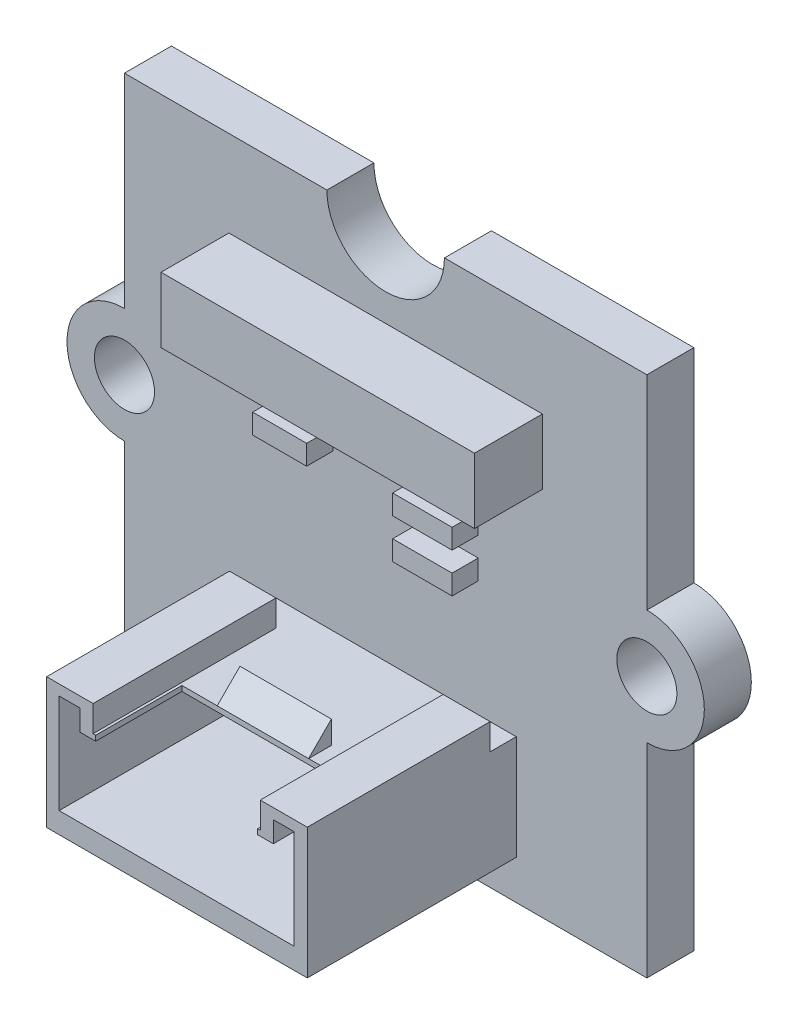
ISO-10303-21;
HEADER;
FILE_DESCRIPTION(('STEP AP214'),'2;1');
FILE_NAME('part.step','',(''),(''),'','','');
FILE_SCHEMA(('AUTOMOTIVE_DESIGN { 1 0 10303 214 1 1 1 1 }'));
ENDSEC;
DATA;
#1=APPLICATION_CONTEXT('core data for automotive mechanical design processes');
#2=APPLICATION_PROTOCOL_DEFINITION('international standard','automotive_design',2000,#1);
#3=PRODUCT_CONTEXT('',#1,'mechanical');
#4=PRODUCT('Part','Part','',(#3));
#5=PRODUCT_RELATED_PRODUCT_CATEGORY('part','',(#4));
#6=PRODUCT_DEFINITION_FORMATION('','',#4);
#7=PRODUCT_DEFINITION_CONTEXT('part definition',#1,'design');
#8=PRODUCT_DEFINITION('design','',#6,#7);
#9=PRODUCT_DEFINITION_SHAPE('','',#8);
#10=(LENGTH_UNIT() NAMED_UNIT(*) SI_UNIT(.MILLI.,.METRE.));
#11=(NAMED_UNIT(*) PLANE_ANGLE_UNIT() SI_UNIT($,.RADIAN.));
#12=(NAMED_UNIT(*) SI_UNIT($,.STERADIAN.) SOLID_ANGLE_UNIT());
#13=UNCERTAINTY_MEASURE_WITH_UNIT(LENGTH_MEASURE(1.E-05),#10,'distance_accuracy_value','');
#14=(GEOMETRIC_REPRESENTATION_CONTEXT(3) GLOBAL_UNCERTAINTY_ASSIGNED_CONTEXT((#13)) GLOBAL_UNIT_ASSIGNED_CONTEXT((#10,
#11,#12)) REPRESENTATION_CONTEXT('',''));
#15=CARTESIAN_POINT('',(0.,0.,0.));
#16=DIRECTION('',(0.,0.,1.));
#17=DIRECTION('',(1.,0.,0.));
#18=AXIS2_PLACEMENT_3D('',#15,#16,#17);
#19=CARTESIAN_POINT('',(-12.7446453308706,0.992907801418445,1.8));
#20=DIRECTION('',(0.,0.,1.));
#21=DIRECTION('',(1.,0.,0.));
#22=AXIS2_PLACEMENT_3D('',#19,#20,#21);
#23=PLANE('',#22);
#24=DIRECTION('',(1.,0.,0.));
#25=VECTOR('',#24,1.);
#26=CARTESIAN_POINT('',(-8.74464533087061,-7.50709219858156,1.8));
#27=LINE('',#26,#25);
#28=CARTESIAN_POINT('',(-7.72290935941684,-7.50709219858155,1.8));
#29=VERTEX_POINT('',#28);
#30=CARTESIAN_POINT('',(-4.42169631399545,-7.50709219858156,1.8));
#31=VERTEX_POINT('',#30);
#32=EDGE_CURVE('E684',#29,#31,#27,.T.);
#33=ORIENTED_EDGE('',*,*,#32,.F.);
#34=DIRECTION('',(0.,1.,0.));
#35=VECTOR('',#34,1.);
#36=CARTESIAN_POINT('',(-7.72290935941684,-2.48765815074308,1.8));
#37=LINE('',#36,#35);
#38=CARTESIAN_POINT('',(-7.72290935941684,-3.50709219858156,1.8));
#39=VERTEX_POINT('',#38);
#40=EDGE_CURVE('E502',#29,#39,#37,.T.);
#41=ORIENTED_EDGE('',*,*,#40,.T.);
#42=DIRECTION('',(-1.,0.,0.));
#43=VECTOR('',#42,1.);
#44=CARTESIAN_POINT('',(-8.74464533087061,-3.50709219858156,1.8));
#45=LINE('',#44,#43);
#46=CARTESIAN_POINT('',(2.25535466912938,-3.50709219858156,1.8));
#47=VERTEX_POINT('',#46);
#48=EDGE_CURVE('E583',#47,#39,#45,.T.);
#49=ORIENTED_EDGE('',*,*,#48,.F.);
#50=DIRECTION('',(0.,1.,0.));
#51=VECTOR('',#50,1.);
#52=CARTESIAN_POINT('',(2.25535466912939,-4.40709219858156,1.8));
#53=LINE('',#52,#51);
#54=CARTESIAN_POINT('',(2.25535466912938,-7.50709219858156,1.8));
#55=VERTEX_POINT('',#54);
#56=EDGE_CURVE('E678',#55,#47,#53,.T.);
#57=ORIENTED_EDGE('',*,*,#56,.F.);
#58=CARTESIAN_POINT('',(-1.06759434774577,-7.50709219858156,1.8));
#59=VERTEX_POINT('',#58);
#60=EDGE_CURVE('E686',#59,#55,#27,.T.);
#61=ORIENTED_EDGE('',*,*,#60,.F.);
#62=CARTESIAN_POINT('',(-2.74464533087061,-9.00709219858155,1.8));
#63=DIRECTION('',(0.,0.,-1.));
#64=DIRECTION('',(1.,0.,0.));
#65=AXIS2_PLACEMENT_3D('',#62,#63,#64);
#66=CIRCLE('',#65,2.25);
#67=CARTESIAN_POINT('',(-0.494645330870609,-9.00709219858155,1.8));
#68=VERTEX_POINT('',#67);
#69=EDGE_CURVE('E710',#59,#68,#66,.T.);
#70=ORIENTED_EDGE('',*,*,#69,.T.);
#71=DIRECTION('',(1.,0.,0.));
#72=VECTOR('',#71,1.);
#73=CARTESIAN_POINT('',(-0.494645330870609,-9.00709219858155,1.8));
#74=LINE('',#73,#72);
#75=CARTESIAN_POINT('',(7.25535466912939,-9.00709219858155,1.8));
#76=VERTEX_POINT('',#75);
#77=EDGE_CURVE('E714',#68,#76,#74,.T.);
#78=ORIENTED_EDGE('',*,*,#77,.T.);
#79=DIRECTION('',(0.,1.,0.));
#80=VECTOR('',#79,1.);
#81=CARTESIAN_POINT('',(7.25535466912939,-1.20709219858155,1.8));
#82=LINE('',#81,#80);
#83=CARTESIAN_POINT('',(7.25535466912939,-1.20709219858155,1.8));
#84=VERTEX_POINT('',#83);
#85=EDGE_CURVE('E717',#76,#84,#82,.T.);
#86=ORIENTED_EDGE('',*,*,#85,.T.);
#87=CARTESIAN_POINT('',(7.25535466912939,0.992907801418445,1.8));
#88=DIRECTION('',(0.,0.,1.));
#89=DIRECTION('',(1.,0.,0.));
#90=AXIS2_PLACEMENT_3D('',#87,#88,#89);
#91=CIRCLE('',#90,2.2);
#92=CARTESIAN_POINT('',(7.25535466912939,3.19290780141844,1.8));
#93=VERTEX_POINT('',#92);
#94=EDGE_CURVE('E719',#84,#93,#91,.T.);
#95=ORIENTED_EDGE('',*,*,#94,.T.);
#96=DIRECTION('',(0.,1.,0.));
#97=VECTOR('',#96,1.);
#98=CARTESIAN_POINT('',(7.25535466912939,10.9929078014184,1.8));
#99=LINE('',#98,#97);
#100=CARTESIAN_POINT('',(7.25535466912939,10.9929078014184,1.8));
#101=VERTEX_POINT('',#100);
#102=EDGE_CURVE('E721',#93,#101,#99,.T.);
#103=ORIENTED_EDGE('',*,*,#102,.T.);
#104=DIRECTION('',(-1.,0.,0.));
#105=VECTOR('',#104,1.);
#106=CARTESIAN_POINT('',(-0.494645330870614,10.9929078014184,1.8));
#107=LINE('',#106,#105);
#108=CARTESIAN_POINT('',(-0.494645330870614,10.9929078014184,1.8));
#109=VERTEX_POINT('',#108);
#110=EDGE_CURVE('E723',#101,#109,#107,.T.);
#111=ORIENTED_EDGE('',*,*,#110,.T.);
#112=CARTESIAN_POINT('',(-2.74464533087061,10.9929078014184,1.8));
#113=DIRECTION('',(0.,0.,-1.));
#114=DIRECTION('',(1.,0.,0.));
#115=AXIS2_PLACEMENT_3D('',#112,#113,#114);
#116=CIRCLE('',#115,2.25);
#117=CARTESIAN_POINT('',(-4.99464533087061,10.9929078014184,1.8));
#118=VERTEX_POINT('',#117);
#119=EDGE_CURVE('E725',#109,#118,#116,.T.);
#120=ORIENTED_EDGE('',*,*,#119,.T.);
#121=DIRECTION('',(-1.,0.,0.));
#122=VECTOR('',#121,1.);
#123=CARTESIAN_POINT('',(-12.7446453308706,10.9929078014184,1.8));
#124=LINE('',#123,#122);
#125=CARTESIAN_POINT('',(-12.7446453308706,10.9929078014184,1.8));
#126=VERTEX_POINT('',#125);
#127=EDGE_CURVE('E727',#118,#126,#124,.T.);
#128=ORIENTED_EDGE('',*,*,#127,.T.);
#129=DIRECTION('',(0.,-1.,0.));
#130=VECTOR('',#129,1.);
#131=CARTESIAN_POINT('',(-12.7446453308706,10.9929078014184,1.8));
#132=LINE('',#131,#130);
#133=CARTESIAN_POINT('',(-12.7446453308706,3.19290780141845,1.8));
#134=VERTEX_POINT('',#133);
#135=EDGE_CURVE('E700',#126,#134,#132,.T.);
#136=ORIENTED_EDGE('',*,*,#135,.T.);
#137=CARTESIAN_POINT('',(-12.7446453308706,0.992907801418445,1.8));
#138=DIRECTION('',(0.,0.,1.));
#139=DIRECTION('',(1.,0.,0.));
#140=AXIS2_PLACEMENT_3D('',#137,#138,#139);
#141=CIRCLE('',#140,2.2);
#142=CARTESIAN_POINT('',(-12.7446453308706,-1.20709219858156,1.8));
#143=VERTEX_POINT('',#142);
#144=EDGE_CURVE('E703',#134,#143,#141,.T.);
#145=ORIENTED_EDGE('',*,*,#144,.T.);
#146=DIRECTION('',(0.,-1.,0.));
#147=VECTOR('',#146,1.);
#148=CARTESIAN_POINT('',(-12.7446453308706,-1.20709219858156,1.8));
#149=LINE('',#148,#147);
#150=CARTESIAN_POINT('',(-12.7446453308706,-9.00709219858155,1.8));
#151=VERTEX_POINT('',#150);
#152=EDGE_CURVE('E706',#143,#151,#149,.T.);
#153=ORIENTED_EDGE('',*,*,#152,.T.);
#154=DIRECTION('',(1.,0.,0.));
#155=VECTOR('',#154,1.);
#156=CARTESIAN_POINT('',(-12.7446453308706,-9.00709219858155,1.8));
#157=LINE('',#156,#155);
#158=CARTESIAN_POINT('',(-4.99464533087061,-9.00709219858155,1.8));
#159=VERTEX_POINT('',#158);
#160=EDGE_CURVE('E708',#151,#159,#157,.T.);
#161=ORIENTED_EDGE('',*,*,#160,.T.);
#162=EDGE_CURVE('E711',#159,#31,#66,.T.);
#163=ORIENTED_EDGE('',*,*,#162,.T.);
#164=EDGE_LOOP('',(#33,#41,#49,#57,#61,#70,#78,#86,#95,#103,#111,#120,#128,#136,#145,#153,#161,#163));
#165=FACE_BOUND('',#164,.T.);
#166=CARTESIAN_POINT('',(-12.7446453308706,0.992907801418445,1.8));
#167=DIRECTION('',(0.,0.,1.));
#168=DIRECTION('',(1.,0.,0.));
#169=AXIS2_PLACEMENT_3D('',#166,#167,#168);
#170=CIRCLE('',#169,1.15);
#171=CARTESIAN_POINT('',(-11.5946453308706,0.992907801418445,1.8));
#172=VERTEX_POINT('',#171);
#173=EDGE_CURVE('E694',#172,#172,#170,.T.);
#174=ORIENTED_EDGE('',*,*,#173,.F.);
#175=EDGE_LOOP('',(#174));
#176=FACE_BOUND('',#175,.T.);
#177=CARTESIAN_POINT('',(7.25535466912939,0.992907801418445,1.8));
#178=DIRECTION('',(0.,0.,1.));
#179=DIRECTION('',(1.,0.,0.));
#180=AXIS2_PLACEMENT_3D('',#177,#178,#179);
#181=CIRCLE('',#180,1.15);
#182=CARTESIAN_POINT('',(8.40535466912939,0.992907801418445,1.8));
#183=VERTEX_POINT('',#182);
#184=EDGE_CURVE('E688',#183,#183,#181,.T.);
#185=ORIENTED_EDGE('',*,*,#184,.F.);
#186=EDGE_LOOP('',(#185));
#187=FACE_BOUND('',#186,.T.);
#188=DIRECTION('',(1.,0.,0.));
#189=VECTOR('',#188,1.);
#190=CARTESIAN_POINT('',(-8.74464533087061,5.19290780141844,1.8));
#191=LINE('',#190,#189);
#192=CARTESIAN_POINT('',(-8.74464533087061,5.19290780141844,1.8));
#193=VERTEX_POINT('',#192);
#194=CARTESIAN_POINT('',(3.25535466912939,5.19290780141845,1.8));
#195=VERTEX_POINT('',#194);
#196=EDGE_CURVE('E486',#193,#195,#191,.T.);
#197=ORIENTED_EDGE('',*,*,#196,.F.);
#198=DIRECTION('',(0.,-1.,0.));
#199=VECTOR('',#198,1.);
#200=CARTESIAN_POINT('',(-8.74464533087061,7.69290780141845,1.8));
#201=LINE('',#200,#199);
#202=CARTESIAN_POINT('',(-8.74464533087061,7.69290780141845,1.8));
#203=VERTEX_POINT('',#202);
#204=EDGE_CURVE('E472',#203,#193,#201,.T.);
#205=ORIENTED_EDGE('',*,*,#204,.F.);
#206=DIRECTION('',(-1.,0.,0.));
#207=VECTOR('',#206,1.);
#208=CARTESIAN_POINT('',(-8.74464533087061,7.69290780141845,1.8));
#209=LINE('',#208,#207);
#210=CARTESIAN_POINT('',(3.25535466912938,7.69290780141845,1.8));
#211=VERTEX_POINT('',#210);
#212=EDGE_CURVE('E477',#211,#203,#209,.T.);
#213=ORIENTED_EDGE('',*,*,#212,.F.);
#214=DIRECTION('',(0.,1.,0.));
#215=VECTOR('',#214,1.);
#216=CARTESIAN_POINT('',(3.25535466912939,7.69290780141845,1.8));
#217=LINE('',#216,#215);
#218=EDGE_CURVE('E488',#195,#211,#217,.T.);
#219=ORIENTED_EDGE('',*,*,#218,.F.);
#220=EDGE_LOOP('',(#197,#205,#213,#219));
#221=FACE_BOUND('',#220,.T.);
#222=DIRECTION('',(1.,0.,0.));
#223=VECTOR('',#222,1.);
#224=CARTESIAN_POINT('',(-6.83694711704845,2.44841719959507,1.8));
#225=LINE('',#224,#223);
#226=CARTESIAN_POINT('',(-6.83694711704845,2.44841719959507,1.8));
#227=VERTEX_POINT('',#226);
#228=CARTESIAN_POINT('',(-4.76970188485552,2.44841719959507,1.8));
#229=VERTEX_POINT('',#228);
#230=EDGE_CURVE('E457',#227,#229,#225,.T.);
#231=ORIENTED_EDGE('',*,*,#230,.F.);
#232=DIRECTION('',(0.,-1.,0.));
#233=VECTOR('',#232,1.);
#234=CARTESIAN_POINT('',(-6.83694711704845,3.20781340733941,1.8));
#235=LINE('',#234,#233);
#236=CARTESIAN_POINT('',(-6.83694711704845,3.20781340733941,1.8));
#237=VERTEX_POINT('',#236);
#238=EDGE_CURVE('E443',#237,#227,#235,.T.);
#239=ORIENTED_EDGE('',*,*,#238,.F.);
#240=DIRECTION('',(-1.,0.,0.));
#241=VECTOR('',#240,1.);
#242=CARTESIAN_POINT('',(-6.83694711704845,3.20781340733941,1.8));
#243=LINE('',#242,#241);
#244=CARTESIAN_POINT('',(-4.76970188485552,3.20781340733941,1.8));
#245=VERTEX_POINT('',#244);
#246=EDGE_CURVE('E448',#245,#237,#243,.T.);
#247=ORIENTED_EDGE('',*,*,#246,.F.);
#248=DIRECTION('',(0.,1.,0.));
#249=VECTOR('',#248,1.);
#250=CARTESIAN_POINT('',(-4.76970188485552,3.20781340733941,1.8));
#251=LINE('',#250,#249);
#252=EDGE_CURVE('E459',#229,#245,#251,.T.);
#253=ORIENTED_EDGE('',*,*,#252,.F.);
#254=EDGE_LOOP('',(#231,#239,#247,#253));
#255=FACE_BOUND('',#254,.T.);
#256=DIRECTION('',(1.,0.,0.));
#257=VECTOR('',#256,1.);
#258=CARTESIAN_POINT('',(-1.47898498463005,2.44841719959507,1.8));
#259=LINE('',#258,#257);
#260=CARTESIAN_POINT('',(-1.47898498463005,2.44841719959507,1.8));
#261=VERTEX_POINT('',#260);
#262=CARTESIAN_POINT('',(0.799203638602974,2.44841719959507,1.8));
#263=VERTEX_POINT('',#262);
#264=EDGE_CURVE('E415',#261,#263,#259,.T.);
#265=ORIENTED_EDGE('',*,*,#264,.F.);
#266=DIRECTION('',(0.,-1.,0.));
#267=VECTOR('',#266,1.);
#268=CARTESIAN_POINT('',(-1.47898498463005,3.20781340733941,1.8));
#269=LINE('',#268,#267);
#270=CARTESIAN_POINT('',(-1.47898498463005,3.20781340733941,1.8));
#271=VERTEX_POINT('',#270);
#272=EDGE_CURVE('E412',#271,#261,#269,.T.);
#273=ORIENTED_EDGE('',*,*,#272,.F.);
#274=DIRECTION('',(-1.,0.,0.));
#275=VECTOR('',#274,1.);
#276=CARTESIAN_POINT('',(-1.47898498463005,3.20781340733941,1.8));
#277=LINE('',#276,#275);
#278=CARTESIAN_POINT('',(0.799203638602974,3.20781340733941,1.8));
#279=VERTEX_POINT('',#278);
#280=EDGE_CURVE('E424',#279,#271,#277,.T.);
#281=ORIENTED_EDGE('',*,*,#280,.F.);
#282=DIRECTION('',(0.,1.,0.));
#283=VECTOR('',#282,1.);
#284=CARTESIAN_POINT('',(0.799203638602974,3.20781340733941,1.8));
#285=LINE('',#284,#283);
#286=EDGE_CURVE('E432',#263,#279,#285,.T.);
#287=ORIENTED_EDGE('',*,*,#286,.F.);
#288=EDGE_LOOP('',(#265,#273,#281,#287));
#289=FACE_BOUND('',#288,.T.);
#290=DIRECTION('',(1.,0.,0.));
#291=VECTOR('',#290,1.);
#292=CARTESIAN_POINT('',(-1.47898498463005,0.929624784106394,1.8));
#293=LINE('',#292,#291);
#294=CARTESIAN_POINT('',(-1.47898498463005,0.929624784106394,1.8));
#295=VERTEX_POINT('',#294);
#296=CARTESIAN_POINT('',(0.799203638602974,0.929624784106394,1.8));
#297=VERTEX_POINT('',#296);
#298=EDGE_CURVE('E1536',#295,#297,#293,.T.);
#299=ORIENTED_EDGE('',*,*,#298,.F.);
#300=DIRECTION('',(0.,-1.,0.));
#301=VECTOR('',#300,1.);
#302=CARTESIAN_POINT('',(-1.47898498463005,1.68902099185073,1.8));
#303=LINE('',#302,#301);
#304=CARTESIAN_POINT('',(-1.47898498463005,1.68902099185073,1.8));
#305=VERTEX_POINT('',#304);
#306=EDGE_CURVE('E410',#305,#295,#303,.T.);
#307=ORIENTED_EDGE('',*,*,#306,.F.);
#308=DIRECTION('',(-1.,0.,0.));
#309=VECTOR('',#308,1.);
#310=CARTESIAN_POINT('',(-1.47898498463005,1.68902099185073,1.8));
#311=LINE('',#310,#309);
#312=CARTESIAN_POINT('',(0.799203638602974,1.68902099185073,1.8));
#313=VERTEX_POINT('',#312);
#314=EDGE_CURVE('E406',#313,#305,#311,.T.);
#315=ORIENTED_EDGE('',*,*,#314,.F.);
#316=DIRECTION('',(0.,1.,0.));
#317=VECTOR('',#316,1.);
#318=CARTESIAN_POINT('',(0.799203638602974,1.68902099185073,1.8));
#319=LINE('',#318,#317);
#320=EDGE_CURVE('E1533',#297,#313,#319,.T.);
#321=ORIENTED_EDGE('',*,*,#320,.F.);
#322=EDGE_LOOP('',(#299,#307,#315,#321));
#323=FACE_BOUND('',#322,.T.);
#324=ADVANCED_FACE('F33',(#165,#176,#187,#221,#255,#289,#323),#23,.T.);
#325=CARTESIAN_POINT('',(-8.74464533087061,-2.50709219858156,9.8));
#326=DIRECTION('',(0.,-1.,0.));
#327=DIRECTION('',(0.,0.,-1.));
#328=AXIS2_PLACEMENT_3D('',#325,#326,#327);
#329=PLANE('',#328);
#330=DIRECTION('',(0.,0.,1.));
#331=VECTOR('',#330,1.);
#332=CARTESIAN_POINT('',(2.25535466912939,-2.50709219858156,9.8));
#333=LINE('',#332,#331);
#334=CARTESIAN_POINT('',(2.25535466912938,-2.50709219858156,2.8));
#335=VERTEX_POINT('',#334);
#336=CARTESIAN_POINT('',(2.25535466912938,-2.50709219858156,9.8));
#337=VERTEX_POINT('',#336);
#338=EDGE_CURVE('E546',#335,#337,#333,.T.);
#339=ORIENTED_EDGE('',*,*,#338,.F.);
#340=DIRECTION('',(1.,0.,0.));
#341=VECTOR('',#340,1.);
#342=CARTESIAN_POINT('',(3.25535466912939,-2.50709219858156,2.8));
#343=LINE('',#342,#341);
#344=CARTESIAN_POINT('',(0.455354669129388,-2.50709219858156,2.8));
#345=VERTEX_POINT('',#344);
#346=EDGE_CURVE('E593',#345,#335,#343,.T.);
#347=ORIENTED_EDGE('',*,*,#346,.F.);
#348=DIRECTION('',(0.,0.,-1.));
#349=VECTOR('',#348,1.);
#350=CARTESIAN_POINT('',(0.455354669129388,-2.50709219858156,2.8));
#351=LINE('',#350,#349);
#352=CARTESIAN_POINT('',(0.455354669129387,-2.50709219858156,9.8));
#353=VERTEX_POINT('',#352);
#354=EDGE_CURVE('E590',#353,#345,#351,.T.);
#355=ORIENTED_EDGE('',*,*,#354,.F.);
#356=DIRECTION('',(-1.,0.,0.));
#357=VECTOR('',#356,1.);
#358=CARTESIAN_POINT('',(-8.74464533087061,-2.50709219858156,9.8));
#359=LINE('',#358,#357);
#360=EDGE_CURVE('E681',#337,#353,#359,.T.);
#361=ORIENTED_EDGE('',*,*,#360,.F.);
#362=EDGE_LOOP('',(#339,#347,#355,#361));
#363=FACE_BOUND('',#362,.T.);
#364=ADVANCED_FACE('F907',(#363),#329,.F.);
#365=CARTESIAN_POINT('',(0.,0.,2.8));
#366=DIRECTION('',(0.,0.,-1.));
#367=DIRECTION('',(-1.,0.,0.));
#368=AXIS2_PLACEMENT_3D('',#365,#366,#367);
#369=PLANE('',#368);
#370=DIRECTION('',(1.,0.,0.));
#371=VECTOR('',#370,1.);
#372=CARTESIAN_POINT('',(0.,-3.50709219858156,2.8));
#373=LINE('',#372,#371);
#374=CARTESIAN_POINT('',(-7.24464533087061,-3.50709219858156,2.8));
#375=VERTEX_POINT('',#374);
#376=CARTESIAN_POINT('',(-6.44464533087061,-3.50709219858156,2.8));
#377=VERTEX_POINT('',#376);
#378=EDGE_CURVE('E791',#375,#377,#373,.T.);
#379=ORIENTED_EDGE('',*,*,#378,.F.);
#380=DIRECTION('',(0.,-1.,0.));
#381=VECTOR('',#380,1.);
#382=CARTESIAN_POINT('',(-7.24464533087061,-3.70709219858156,2.8));
#383=LINE('',#382,#381);
#384=CARTESIAN_POINT('',(-7.24464533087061,-6.70709219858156,2.8));
#385=VERTEX_POINT('',#384);
#386=EDGE_CURVE('E611',#375,#385,#383,.T.);
#387=ORIENTED_EDGE('',*,*,#386,.T.);
#388=DIRECTION('',(1.,0.,0.));
#389=VECTOR('',#388,1.);
#390=CARTESIAN_POINT('',(-7.24464533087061,-6.70709219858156,2.8));
#391=LINE('',#390,#389);
#392=CARTESIAN_POINT('',(1.75535466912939,-6.70709219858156,2.8));
#393=VERTEX_POINT('',#392);
#394=EDGE_CURVE('E610',#385,#393,#391,.T.);
#395=ORIENTED_EDGE('',*,*,#394,.T.);
#396=DIRECTION('',(0.,1.,0.));
#397=VECTOR('',#396,1.);
#398=CARTESIAN_POINT('',(1.75535466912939,-3.70709219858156,2.8));
#399=LINE('',#398,#397);
#400=CARTESIAN_POINT('',(1.75535466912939,-3.50709219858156,2.8));
#401=VERTEX_POINT('',#400);
#402=EDGE_CURVE('E615',#393,#401,#399,.T.);
#403=ORIENTED_EDGE('',*,*,#402,.T.);
#404=CARTESIAN_POINT('',(0.955354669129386,-3.50709219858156,2.8));
#405=VERTEX_POINT('',#404);
#406=EDGE_CURVE('E788',#405,#401,#373,.T.);
#407=ORIENTED_EDGE('',*,*,#406,.F.);
#408=DIRECTION('',(0.,-1.,0.));
#409=VECTOR('',#408,1.);
#410=CARTESIAN_POINT('',(0.955354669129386,-2.90709219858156,2.8));
#411=LINE('',#410,#409);
#412=CARTESIAN_POINT('',(0.955354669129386,-3.70709219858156,2.8));
#413=VERTEX_POINT('',#412);
#414=EDGE_CURVE('E620',#405,#413,#411,.T.);
#415=ORIENTED_EDGE('',*,*,#414,.T.);
#416=DIRECTION('',(-1.,0.,0.));
#417=VECTOR('',#416,1.);
#418=CARTESIAN_POINT('',(-6.44464533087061,-3.70709219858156,2.8));
#419=LINE('',#418,#417);
#420=CARTESIAN_POINT('',(-6.44464533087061,-3.70709219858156,2.8));
#421=VERTEX_POINT('',#420);
#422=EDGE_CURVE('E624',#413,#421,#419,.T.);
#423=ORIENTED_EDGE('',*,*,#422,.T.);
#424=DIRECTION('',(0.,1.,0.));
#425=VECTOR('',#424,1.);
#426=CARTESIAN_POINT('',(-6.44464533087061,-2.90709219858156,2.8));
#427=LINE('',#426,#425);
#428=EDGE_CURVE('E628',#421,#377,#427,.T.);
#429=ORIENTED_EDGE('',*,*,#428,.T.);
#430=EDGE_LOOP('',(#379,#387,#395,#403,#407,#415,#423,#429));
#431=FACE_BOUND('',#430,.T.);
#432=ADVANCED_FACE('F858',(#431),#369,.F.);
#433=CARTESIAN_POINT('',(-12.7446453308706,0.992907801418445,0.));
#434=DIRECTION('',(0.,0.,1.));
#435=DIRECTION('',(1.,0.,0.));
#436=AXIS2_PLACEMENT_3D('',#433,#434,#435);
#437=PLANE('',#436);
#438=DIRECTION('',(0.,-1.,0.));
#439=VECTOR('',#438,1.);
#440=CARTESIAN_POINT('',(-12.7446453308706,10.9929078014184,0.));
#441=LINE('',#440,#439);
#442=CARTESIAN_POINT('',(-12.7446453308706,10.9929078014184,0.));
#443=VERTEX_POINT('',#442);
#444=CARTESIAN_POINT('',(-12.7446453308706,3.19290780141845,0.));
#445=VERTEX_POINT('',#444);
#446=EDGE_CURVE('E697',#443,#445,#441,.T.);
#447=ORIENTED_EDGE('',*,*,#446,.F.);
#448=DIRECTION('',(-1.,0.,0.));
#449=VECTOR('',#448,1.);
#450=CARTESIAN_POINT('',(-12.7446453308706,10.9929078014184,0.));
#451=LINE('',#450,#449);
#452=CARTESIAN_POINT('',(-4.99464533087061,10.9929078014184,0.));
#453=VERTEX_POINT('',#452);
#454=EDGE_CURVE('E704',#453,#443,#451,.T.);
#455=ORIENTED_EDGE('',*,*,#454,.F.);
#456=CARTESIAN_POINT('',(-2.74464533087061,10.9929078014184,0.));
#457=DIRECTION('',(0.,0.,-1.));
#458=DIRECTION('',(1.,0.,0.));
#459=AXIS2_PLACEMENT_3D('',#456,#457,#458);
#460=CIRCLE('',#459,2.25);
#461=CARTESIAN_POINT('',(-0.494645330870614,10.9929078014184,0.));
#462=VERTEX_POINT('',#461);
#463=EDGE_CURVE('E750',#462,#453,#460,.T.);
#464=ORIENTED_EDGE('',*,*,#463,.F.);
#465=DIRECTION('',(-1.,0.,0.));
#466=VECTOR('',#465,1.);
#467=CARTESIAN_POINT('',(-0.494645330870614,10.9929078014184,0.));
#468=LINE('',#467,#466);
#469=CARTESIAN_POINT('',(7.25535466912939,10.9929078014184,0.));
#470=VERTEX_POINT('',#469);
#471=EDGE_CURVE('E748',#470,#462,#468,.T.);
#472=ORIENTED_EDGE('',*,*,#471,.F.);
#473=DIRECTION('',(0.,1.,0.));
#474=VECTOR('',#473,1.);
#475=CARTESIAN_POINT('',(7.25535466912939,10.9929078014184,0.));
#476=LINE('',#475,#474);
#477=CARTESIAN_POINT('',(7.25535466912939,3.19290780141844,0.));
#478=VERTEX_POINT('',#477);
#479=EDGE_CURVE('E746',#478,#470,#476,.T.);
#480=ORIENTED_EDGE('',*,*,#479,.F.);
#481=CARTESIAN_POINT('',(7.25535466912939,0.992907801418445,0.));
#482=DIRECTION('',(0.,0.,1.));
#483=DIRECTION('',(1.,0.,0.));
#484=AXIS2_PLACEMENT_3D('',#481,#482,#483);
#485=CIRCLE('',#484,2.2);
#486=CARTESIAN_POINT('',(7.25535466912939,-1.20709219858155,0.));
#487=VERTEX_POINT('',#486);
#488=EDGE_CURVE('E744',#487,#478,#485,.T.);
#489=ORIENTED_EDGE('',*,*,#488,.F.);
#490=DIRECTION('',(0.,1.,0.));
#491=VECTOR('',#490,1.);
#492=CARTESIAN_POINT('',(7.25535466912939,-1.20709219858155,0.));
#493=LINE('',#492,#491);
#494=CARTESIAN_POINT('',(7.25535466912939,-9.00709219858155,0.));
#495=VERTEX_POINT('',#494);
#496=EDGE_CURVE('E742',#495,#487,#493,.T.);
#497=ORIENTED_EDGE('',*,*,#496,.F.);
#498=DIRECTION('',(1.,0.,0.));
#499=VECTOR('',#498,1.);
#500=CARTESIAN_POINT('',(-0.494645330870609,-9.00709219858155,0.));
#501=LINE('',#500,#499);
#502=CARTESIAN_POINT('',(-0.494645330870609,-9.00709219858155,0.));
#503=VERTEX_POINT('',#502);
#504=EDGE_CURVE('E740',#503,#495,#501,.T.);
#505=ORIENTED_EDGE('',*,*,#504,.F.);
#506=CARTESIAN_POINT('',(-2.74464533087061,-9.00709219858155,0.));
#507=DIRECTION('',(0.,0.,-1.));
#508=DIRECTION('',(1.,0.,0.));
#509=AXIS2_PLACEMENT_3D('',#506,#507,#508);
#510=CIRCLE('',#509,2.25);
#511=CARTESIAN_POINT('',(-4.99464533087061,-9.00709219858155,0.));
#512=VERTEX_POINT('',#511);
#513=EDGE_CURVE('E738',#512,#503,#510,.T.);
#514=ORIENTED_EDGE('',*,*,#513,.F.);
#515=DIRECTION('',(1.,0.,0.));
#516=VECTOR('',#515,1.);
#517=CARTESIAN_POINT('',(-12.7446453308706,-9.00709219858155,0.));
#518=LINE('',#517,#516);
#519=CARTESIAN_POINT('',(-12.7446453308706,-9.00709219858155,0.));
#520=VERTEX_POINT('',#519);
#521=EDGE_CURVE('E736',#520,#512,#518,.T.);
#522=ORIENTED_EDGE('',*,*,#521,.F.);
#523=DIRECTION('',(0.,-1.,0.));
#524=VECTOR('',#523,1.);
#525=CARTESIAN_POINT('',(-12.7446453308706,-1.20709219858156,0.));
#526=LINE('',#525,#524);
#527=CARTESIAN_POINT('',(-12.7446453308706,-1.20709219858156,0.));
#528=VERTEX_POINT('',#527);
#529=EDGE_CURVE('E734',#528,#520,#526,.T.);
#530=ORIENTED_EDGE('',*,*,#529,.F.);
#531=CARTESIAN_POINT('',(-12.7446453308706,0.992907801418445,0.));
#532=DIRECTION('',(0.,0.,1.));
#533=DIRECTION('',(1.,0.,0.));
#534=AXIS2_PLACEMENT_3D('',#531,#532,#533);
#535=CIRCLE('',#534,2.2);
#536=EDGE_CURVE('E732',#445,#528,#535,.T.);
#537=ORIENTED_EDGE('',*,*,#536,.F.);
#538=EDGE_LOOP('',(#447,#455,#464,#472,#480,#489,#497,#505,#514,#522,#530,#537));
#539=FACE_BOUND('',#538,.T.);
#540=CARTESIAN_POINT('',(-12.7446453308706,0.992907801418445,0.));
#541=DIRECTION('',(0.,0.,1.));
#542=DIRECTION('',(1.,0.,0.));
#543=AXIS2_PLACEMENT_3D('',#540,#541,#542);
#544=CIRCLE('',#543,1.15);
#545=CARTESIAN_POINT('',(-11.5946453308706,0.992907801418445,0.));
#546=VERTEX_POINT('',#545);
#547=EDGE_CURVE('E691',#546,#546,#544,.T.);
#548=ORIENTED_EDGE('',*,*,#547,.T.);
#549=EDGE_LOOP('',(#548));
#550=FACE_BOUND('',#549,.T.);
#551=CARTESIAN_POINT('',(7.25535466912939,0.992907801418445,0.));
#552=DIRECTION('',(0.,0.,1.));
#553=DIRECTION('',(1.,0.,0.));
#554=AXIS2_PLACEMENT_3D('',#551,#552,#553);
#555=CIRCLE('',#554,1.15);
#556=CARTESIAN_POINT('',(8.40535466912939,0.992907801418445,0.));
#557=VERTEX_POINT('',#556);
#558=EDGE_CURVE('E683',#557,#557,#555,.T.);
#559=ORIENTED_EDGE('',*,*,#558,.T.);
#560=EDGE_LOOP('',(#559));
#561=FACE_BOUND('',#560,.T.);
#562=ADVANCED_FACE('F924',(#539,#550,#561),#437,.F.);
#563=CARTESIAN_POINT('',(-12.7446453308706,10.9929078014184,1.8));
#564=DIRECTION('',(1.,0.,0.));
#565=DIRECTION('',(0.,1.,0.));
#566=AXIS2_PLACEMENT_3D('',#563,#564,#565);
#567=PLANE('',#566);
#568=ORIENTED_EDGE('',*,*,#446,.T.);
#569=DIRECTION('',(0.,0.,-1.));
#570=VECTOR('',#569,1.);
#571=CARTESIAN_POINT('',(-12.7446453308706,3.19290780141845,1.8));
#572=LINE('',#571,#570);
#573=EDGE_CURVE('E785',#134,#445,#572,.T.);
#574=ORIENTED_EDGE('',*,*,#573,.F.);
#575=ORIENTED_EDGE('',*,*,#135,.F.);
#576=DIRECTION('',(0.,0.,-1.));
#577=VECTOR('',#576,1.);
#578=CARTESIAN_POINT('',(-12.7446453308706,10.9929078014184,1.8));
#579=LINE('',#578,#577);
#580=EDGE_CURVE('E729',#126,#443,#579,.T.);
#581=ORIENTED_EDGE('',*,*,#580,.T.);
#582=EDGE_LOOP('',(#568,#574,#575,#581));
#583=FACE_BOUND('',#582,.T.);
#584=ADVANCED_FACE('F927',(#583),#567,.F.);
#585=CARTESIAN_POINT('',(-12.7446453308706,0.992907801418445,1.8));
#586=DIRECTION('',(0.,0.,-1.));
#587=DIRECTION('',(-1.,0.,0.));
#588=AXIS2_PLACEMENT_3D('',#585,#586,#587);
#589=CYLINDRICAL_SURFACE('',#588,2.2);
#590=ORIENTED_EDGE('',*,*,#536,.T.);
#591=DIRECTION('',(0.,0.,-1.));
#592=VECTOR('',#591,1.);
#593=CARTESIAN_POINT('',(-12.7446453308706,-1.20709219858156,1.8));
#594=LINE('',#593,#592);
#595=EDGE_CURVE('E782',#143,#528,#594,.T.);
#596=ORIENTED_EDGE('',*,*,#595,.F.);
#597=ORIENTED_EDGE('',*,*,#144,.F.);
#598=ORIENTED_EDGE('',*,*,#573,.T.);
#599=EDGE_LOOP('',(#590,#596,#597,#598));
#600=FACE_BOUND('',#599,.T.);
#601=ADVANCED_FACE('F968',(#600),#589,.T.);
#602=CARTESIAN_POINT('',(-12.7446453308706,-1.20709219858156,1.8));
#603=DIRECTION('',(1.,0.,0.));
#604=DIRECTION('',(0.,1.,0.));
#605=AXIS2_PLACEMENT_3D('',#602,#603,#604);
#606=PLANE('',#605);
#607=ORIENTED_EDGE('',*,*,#529,.T.);
#608=DIRECTION('',(0.,0.,-1.));
#609=VECTOR('',#608,1.);
#610=CARTESIAN_POINT('',(-12.7446453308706,-9.00709219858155,1.8));
#611=LINE('',#610,#609);
#612=EDGE_CURVE('E779',#151,#520,#611,.T.);
#613=ORIENTED_EDGE('',*,*,#612,.F.);
#614=ORIENTED_EDGE('',*,*,#152,.F.);
#615=ORIENTED_EDGE('',*,*,#595,.T.);
#616=EDGE_LOOP('',(#607,#613,#614,#615));
#617=FACE_BOUND('',#616,.T.);
#618=ADVANCED_FACE('F964',(#617),#606,.F.);
#619=CARTESIAN_POINT('',(-12.7446453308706,-9.00709219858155,1.8));
#620=DIRECTION('',(0.,1.,0.));
#621=DIRECTION('',(0.,0.,1.));
#622=AXIS2_PLACEMENT_3D('',#619,#620,#621);
#623=PLANE('',#622);
#624=ORIENTED_EDGE('',*,*,#521,.T.);
#625=DIRECTION('',(0.,0.,-1.));
#626=VECTOR('',#625,1.);
#627=CARTESIAN_POINT('',(-4.99464533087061,-9.00709219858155,1.8));
#628=LINE('',#627,#626);
#629=EDGE_CURVE('E776',#159,#512,#628,.T.);
#630=ORIENTED_EDGE('',*,*,#629,.F.);
#631=ORIENTED_EDGE('',*,*,#160,.F.);
#632=ORIENTED_EDGE('',*,*,#612,.T.);
#633=EDGE_LOOP('',(#624,#630,#631,#632));
#634=FACE_BOUND('',#633,.T.);
#635=ADVANCED_FACE('F960',(#634),#623,.F.);
#636=CARTESIAN_POINT('',(-2.74464533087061,-9.00709219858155,1.8));
#637=DIRECTION('',(0.,0.,-1.));
#638=DIRECTION('',(-1.,0.,0.));
#639=AXIS2_PLACEMENT_3D('',#636,#637,#638);
#640=CYLINDRICAL_SURFACE('',#639,2.25);
#641=ORIENTED_EDGE('',*,*,#513,.T.);
#642=DIRECTION('',(0.,0.,-1.));
#643=VECTOR('',#642,1.);
#644=CARTESIAN_POINT('',(-0.494645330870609,-9.00709219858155,1.8));
#645=LINE('',#644,#643);
#646=EDGE_CURVE('E773',#68,#503,#645,.T.);
#647=ORIENTED_EDGE('',*,*,#646,.F.);
#648=ORIENTED_EDGE('',*,*,#69,.F.);
#649=EDGE_CURVE('E715',#31,#59,#66,.T.);
#650=ORIENTED_EDGE('',*,*,#649,.F.);
#651=ORIENTED_EDGE('',*,*,#162,.F.);
#652=ORIENTED_EDGE('',*,*,#629,.T.);
#653=EDGE_LOOP('',(#641,#647,#648,#650,#651,#652));
#654=FACE_BOUND('',#653,.T.);
#655=ADVANCED_FACE('F956',(#654),#640,.F.);
#656=CARTESIAN_POINT('',(-0.494645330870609,-9.00709219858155,1.8));
#657=DIRECTION('',(0.,1.,0.));
#658=DIRECTION('',(0.,0.,1.));
#659=AXIS2_PLACEMENT_3D('',#656,#657,#658);
#660=PLANE('',#659);
#661=ORIENTED_EDGE('',*,*,#504,.T.);
#662=DIRECTION('',(0.,0.,-1.));
#663=VECTOR('',#662,1.);
#664=CARTESIAN_POINT('',(7.25535466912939,-9.00709219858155,1.8));
#665=LINE('',#664,#663);
#666=EDGE_CURVE('E770',#76,#495,#665,.T.);
#667=ORIENTED_EDGE('',*,*,#666,.F.);
#668=ORIENTED_EDGE('',*,*,#77,.F.);
#669=ORIENTED_EDGE('',*,*,#646,.T.);
#670=EDGE_LOOP('',(#661,#667,#668,#669));
#671=FACE_BOUND('',#670,.T.);
#672=ADVANCED_FACE('F952',(#671),#660,.F.);
#673=CARTESIAN_POINT('',(7.25535466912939,-1.20709219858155,1.8));
#674=DIRECTION('',(-1.,0.,0.));
#675=DIRECTION('',(0.,-1.,0.));
#676=AXIS2_PLACEMENT_3D('',#673,#674,#675);
#677=PLANE('',#676);
#678=ORIENTED_EDGE('',*,*,#496,.T.);
#679=DIRECTION('',(0.,0.,-1.));
#680=VECTOR('',#679,1.);
#681=CARTESIAN_POINT('',(7.25535466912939,-1.20709219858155,1.8));
#682=LINE('',#681,#680);
#683=EDGE_CURVE('E767',#84,#487,#682,.T.);
#684=ORIENTED_EDGE('',*,*,#683,.F.);
#685=ORIENTED_EDGE('',*,*,#85,.F.);
#686=ORIENTED_EDGE('',*,*,#666,.T.);
#687=EDGE_LOOP('',(#678,#684,#685,#686));
#688=FACE_BOUND('',#687,.T.);
#689=ADVANCED_FACE('F948',(#688),#677,.F.);
#690=CARTESIAN_POINT('',(7.25535466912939,0.992907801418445,1.8));
#691=DIRECTION('',(0.,0.,-1.));
#692=DIRECTION('',(-1.,0.,0.));
#693=AXIS2_PLACEMENT_3D('',#690,#691,#692);
#694=CYLINDRICAL_SURFACE('',#693,2.2);
#695=ORIENTED_EDGE('',*,*,#488,.T.);
#696=DIRECTION('',(0.,0.,-1.));
#697=VECTOR('',#696,1.);
#698=CARTESIAN_POINT('',(7.25535466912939,3.19290780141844,1.8));
#699=LINE('',#698,#697);
#700=EDGE_CURVE('E764',#93,#478,#699,.T.);
#701=ORIENTED_EDGE('',*,*,#700,.F.);
#702=ORIENTED_EDGE('',*,*,#94,.F.);
#703=ORIENTED_EDGE('',*,*,#683,.T.);
#704=EDGE_LOOP('',(#695,#701,#702,#703));
#705=FACE_BOUND('',#704,.T.);
#706=ADVANCED_FACE('F944',(#705),#694,.T.);
#707=CARTESIAN_POINT('',(7.25535466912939,10.9929078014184,1.8));
#708=DIRECTION('',(-1.,0.,0.));
#709=DIRECTION('',(0.,-1.,0.));
#710=AXIS2_PLACEMENT_3D('',#707,#708,#709);
#711=PLANE('',#710);
#712=ORIENTED_EDGE('',*,*,#479,.T.);
#713=DIRECTION('',(0.,0.,-1.));
#714=VECTOR('',#713,1.);
#715=CARTESIAN_POINT('',(7.25535466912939,10.9929078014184,1.8));
#716=LINE('',#715,#714);
#717=EDGE_CURVE('E761',#101,#470,#716,.T.);
#718=ORIENTED_EDGE('',*,*,#717,.F.);
#719=ORIENTED_EDGE('',*,*,#102,.F.);
#720=ORIENTED_EDGE('',*,*,#700,.T.);
#721=EDGE_LOOP('',(#712,#718,#719,#720));
#722=FACE_BOUND('',#721,.T.);
#723=ADVANCED_FACE('F940',(#722),#711,.F.);
#724=CARTESIAN_POINT('',(-0.494645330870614,10.9929078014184,1.8));
#725=DIRECTION('',(0.,-1.,0.));
#726=DIRECTION('',(0.,0.,-1.));
#727=AXIS2_PLACEMENT_3D('',#724,#725,#726);
#728=PLANE('',#727);
#729=ORIENTED_EDGE('',*,*,#471,.T.);
#730=DIRECTION('',(0.,0.,-1.));
#731=VECTOR('',#730,1.);
#732=CARTESIAN_POINT('',(-0.494645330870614,10.9929078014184,1.8));
#733=LINE('',#732,#731);
#734=EDGE_CURVE('E758',#109,#462,#733,.T.);
#735=ORIENTED_EDGE('',*,*,#734,.F.);
#736=ORIENTED_EDGE('',*,*,#110,.F.);
#737=ORIENTED_EDGE('',*,*,#717,.T.);
#738=EDGE_LOOP('',(#729,#735,#736,#737));
#739=FACE_BOUND('',#738,.T.);
#740=ADVANCED_FACE('F936',(#739),#728,.F.);
#741=CARTESIAN_POINT('',(-2.74464533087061,10.9929078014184,1.8));
#742=DIRECTION('',(0.,0.,-1.));
#743=DIRECTION('',(-1.,0.,0.));
#744=AXIS2_PLACEMENT_3D('',#741,#742,#743);
#745=CYLINDRICAL_SURFACE('',#744,2.25);
#746=ORIENTED_EDGE('',*,*,#463,.T.);
#747=DIRECTION('',(0.,0.,-1.));
#748=VECTOR('',#747,1.);
#749=CARTESIAN_POINT('',(-4.99464533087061,10.9929078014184,1.8));
#750=LINE('',#749,#748);
#751=EDGE_CURVE('E755',#118,#453,#750,.T.);
#752=ORIENTED_EDGE('',*,*,#751,.F.);
#753=ORIENTED_EDGE('',*,*,#119,.F.);
#754=ORIENTED_EDGE('',*,*,#734,.T.);
#755=EDGE_LOOP('',(#746,#752,#753,#754));
#756=FACE_BOUND('',#755,.T.);
#757=ADVANCED_FACE('F932',(#756),#745,.F.);
#758=CARTESIAN_POINT('',(-12.7446453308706,10.9929078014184,1.8));
#759=DIRECTION('',(0.,-1.,0.));
#760=DIRECTION('',(0.,0.,-1.));
#761=AXIS2_PLACEMENT_3D('',#758,#759,#760);
#762=PLANE('',#761);
#763=ORIENTED_EDGE('',*,*,#454,.T.);
#764=ORIENTED_EDGE('',*,*,#580,.F.);
#765=ORIENTED_EDGE('',*,*,#127,.F.);
#766=ORIENTED_EDGE('',*,*,#751,.T.);
#767=EDGE_LOOP('',(#763,#764,#765,#766));
#768=FACE_BOUND('',#767,.T.);
#769=ADVANCED_FACE('F929',(#768),#762,.F.);
#770=CARTESIAN_POINT('',(-12.7446453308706,0.992907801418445,1.8));
#771=DIRECTION('',(0.,0.,-1.));
#772=DIRECTION('',(-1.,0.,0.));
#773=AXIS2_PLACEMENT_3D('',#770,#771,#772);
#774=CYLINDRICAL_SURFACE('',#773,1.15);
#775=ORIENTED_EDGE('',*,*,#173,.T.);
#776=EDGE_LOOP('',(#775));
#777=FACE_BOUND('',#776,.T.);
#778=ORIENTED_EDGE('',*,*,#547,.F.);
#779=EDGE_LOOP('',(#778));
#780=FACE_BOUND('',#779,.T.);
#781=ADVANCED_FACE('F922',(#777,#780),#774,.F.);
#782=CARTESIAN_POINT('',(7.25535466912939,0.992907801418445,1.8));
#783=DIRECTION('',(0.,0.,-1.));
#784=DIRECTION('',(-1.,0.,0.));
#785=AXIS2_PLACEMENT_3D('',#782,#783,#784);
#786=CYLINDRICAL_SURFACE('',#785,1.15);
#787=ORIENTED_EDGE('',*,*,#184,.T.);
#788=EDGE_LOOP('',(#787));
#789=FACE_BOUND('',#788,.T.);
#790=ORIENTED_EDGE('',*,*,#558,.F.);
#791=EDGE_LOOP('',(#790));
#792=FACE_BOUND('',#791,.T.);
#793=ADVANCED_FACE('F1149',(#789,#792),#786,.F.);
#794=CARTESIAN_POINT('',(-8.74464533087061,-7.50709219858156,9.8));
#795=DIRECTION('',(0.,1.,0.));
#796=DIRECTION('',(0.,0.,1.));
#797=AXIS2_PLACEMENT_3D('',#794,#795,#796);
#798=PLANE('',#797);
#799=DIRECTION('',(1.,0.,0.));
#800=VECTOR('',#799,1.);
#801=CARTESIAN_POINT('',(-8.74464533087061,-7.50709219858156,9.8));
#802=LINE('',#801,#800);
#803=CARTESIAN_POINT('',(-7.72290935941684,-7.50709219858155,9.8));
#804=VERTEX_POINT('',#803);
#805=CARTESIAN_POINT('',(2.25535466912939,-7.50709219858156,9.8));
#806=VERTEX_POINT('',#805);
#807=EDGE_CURVE('E675',#804,#806,#802,.T.);
#808=ORIENTED_EDGE('',*,*,#807,.F.);
#809=DIRECTION('',(0.,0.,-1.));
#810=VECTOR('',#809,1.);
#811=CARTESIAN_POINT('',(-7.72290935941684,-7.50709219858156,9.8));
#812=LINE('',#811,#810);
#813=EDGE_CURVE('E516',#804,#29,#812,.T.);
#814=ORIENTED_EDGE('',*,*,#813,.T.);
#815=ORIENTED_EDGE('',*,*,#32,.T.);
#816=EDGE_CURVE('E660',#31,#59,#27,.T.);
#817=ORIENTED_EDGE('',*,*,#816,.T.);
#818=ORIENTED_EDGE('',*,*,#60,.T.);
#819=DIRECTION('',(0.,0.,1.));
#820=VECTOR('',#819,1.);
#821=CARTESIAN_POINT('',(2.25535466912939,-7.50709219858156,9.8));
#822=LINE('',#821,#820);
#823=EDGE_CURVE('E549',#55,#806,#822,.T.);
#824=ORIENTED_EDGE('',*,*,#823,.T.);
#825=EDGE_LOOP('',(#808,#814,#815,#817,#818,#824));
#826=FACE_BOUND('',#825,.T.);
#827=ADVANCED_FACE('F1019',(#826),#798,.F.);
#828=CARTESIAN_POINT('',(2.25535466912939,-4.40709219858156,9.8));
#829=DIRECTION('',(-1.,0.,0.));
#830=DIRECTION('',(0.,0.,1.));
#831=AXIS2_PLACEMENT_3D('',#828,#829,#830);
#832=PLANE('',#831);
#833=ORIENTED_EDGE('',*,*,#823,.F.);
#834=ORIENTED_EDGE('',*,*,#56,.T.);
#835=DIRECTION('',(0.,0.,1.));
#836=VECTOR('',#835,1.);
#837=CARTESIAN_POINT('',(2.25535466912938,-3.50709219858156,0.));
#838=LINE('',#837,#836);
#839=CARTESIAN_POINT('',(2.25535466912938,-3.50709219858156,2.8));
#840=VERTEX_POINT('',#839);
#841=EDGE_CURVE('E504',#47,#840,#838,.T.);
#842=ORIENTED_EDGE('',*,*,#841,.T.);
#843=DIRECTION('',(0.,-1.,0.));
#844=VECTOR('',#843,1.);
#845=CARTESIAN_POINT('',(2.25535466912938,-3.50709219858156,2.8));
#846=LINE('',#845,#844);
#847=EDGE_CURVE('E507',#335,#840,#846,.T.);
#848=ORIENTED_EDGE('',*,*,#847,.F.);
#849=ORIENTED_EDGE('',*,*,#338,.T.);
#850=DIRECTION('',(0.,1.,0.));
#851=VECTOR('',#850,1.);
#852=CARTESIAN_POINT('',(2.25535466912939,-4.40709219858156,9.8));
#853=LINE('',#852,#851);
#854=EDGE_CURVE('E677',#806,#337,#853,.T.);
#855=ORIENTED_EDGE('',*,*,#854,.F.);
#856=EDGE_LOOP('',(#833,#834,#842,#848,#849,#855));
#857=FACE_BOUND('',#856,.T.);
#858=ADVANCED_FACE('F1024',(#857),#832,.F.);
#859=DIRECTION('',(1.,0.,0.));
#860=VECTOR('',#859,1.);
#861=CARTESIAN_POINT('',(-8.74464533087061,-2.50709219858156,2.8));
#862=LINE('',#861,#860);
#863=CARTESIAN_POINT('',(-7.72290935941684,-2.50709219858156,2.8));
#864=VERTEX_POINT('',#863);
#865=CARTESIAN_POINT('',(-5.94464533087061,-2.50709219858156,2.8));
#866=VERTEX_POINT('',#865);
#867=EDGE_CURVE('E565',#864,#866,#862,.T.);
#868=ORIENTED_EDGE('',*,*,#867,.F.);
#869=DIRECTION('',(0.,0.,1.));
#870=VECTOR('',#869,1.);
#871=CARTESIAN_POINT('',(-7.72290935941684,-2.50709219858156,9.8));
#872=LINE('',#871,#870);
#873=CARTESIAN_POINT('',(-7.72290935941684,-2.50709219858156,9.8));
#874=VERTEX_POINT('',#873);
#875=EDGE_CURVE('E513',#864,#874,#872,.T.);
#876=ORIENTED_EDGE('',*,*,#875,.T.);
#877=CARTESIAN_POINT('',(-5.94464533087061,-2.50709219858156,9.8));
#878=VERTEX_POINT('',#877);
#879=EDGE_CURVE('E680',#878,#874,#359,.T.);
#880=ORIENTED_EDGE('',*,*,#879,.F.);
#881=DIRECTION('',(0.,0.,1.));
#882=VECTOR('',#881,1.);
#883=CARTESIAN_POINT('',(-5.94464533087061,-2.50709219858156,2.8));
#884=LINE('',#883,#882);
#885=EDGE_CURVE('E588',#866,#878,#884,.T.);
#886=ORIENTED_EDGE('',*,*,#885,.F.);
#887=EDGE_LOOP('',(#868,#876,#880,#886));
#888=FACE_BOUND('',#887,.T.);
#889=ADVANCED_FACE('F917',(#888),#329,.F.);
#890=CARTESIAN_POINT('',(0.,0.,9.8));
#891=DIRECTION('',(0.,0.,-1.));
#892=DIRECTION('',(-1.,0.,0.));
#893=AXIS2_PLACEMENT_3D('',#890,#891,#892);
#894=PLANE('',#893);
#895=ORIENTED_EDGE('',*,*,#879,.T.);
#896=DIRECTION('',(0.,1.,0.));
#897=VECTOR('',#896,1.);
#898=CARTESIAN_POINT('',(-7.72290935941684,-2.48765815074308,9.8));
#899=LINE('',#898,#897);
#900=EDGE_CURVE('E501',#804,#874,#899,.T.);
#901=ORIENTED_EDGE('',*,*,#900,.F.);
#902=ORIENTED_EDGE('',*,*,#807,.T.);
#903=ORIENTED_EDGE('',*,*,#854,.T.);
#904=ORIENTED_EDGE('',*,*,#360,.T.);
#905=DIRECTION('',(0.,1.,0.));
#906=VECTOR('',#905,1.);
#907=CARTESIAN_POINT('',(0.455354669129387,-3.50709219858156,9.8));
#908=LINE('',#907,#906);
#909=CARTESIAN_POINT('',(0.455354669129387,-3.50709219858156,9.8));
#910=VERTEX_POINT('',#909);
#911=EDGE_CURVE('E599',#910,#353,#908,.T.);
#912=ORIENTED_EDGE('',*,*,#911,.F.);
#913=DIRECTION('',(1.,0.,0.));
#914=VECTOR('',#913,1.);
#915=CARTESIAN_POINT('',(0.455354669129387,-3.50709219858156,9.8));
#916=LINE('',#915,#914);
#917=CARTESIAN_POINT('',(0.355354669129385,-3.50709219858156,9.8));
#918=VERTEX_POINT('',#917);
#919=EDGE_CURVE('E573',#918,#910,#916,.T.);
#920=ORIENTED_EDGE('',*,*,#919,.F.);
#921=DIRECTION('',(0.,1.,0.));
#922=VECTOR('',#921,1.);
#923=CARTESIAN_POINT('',(0.355354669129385,-4.50709219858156,9.8));
#924=LINE('',#923,#922);
#925=CARTESIAN_POINT('',(0.355354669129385,-3.70709219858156,9.8));
#926=VERTEX_POINT('',#925);
#927=EDGE_CURVE('E534',#926,#918,#924,.T.);
#928=ORIENTED_EDGE('',*,*,#927,.F.);
#929=DIRECTION('',(-1.,0.,0.));
#930=VECTOR('',#929,1.);
#931=CARTESIAN_POINT('',(-6.44464533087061,-3.70709219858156,9.8));
#932=LINE('',#931,#930);
#933=CARTESIAN_POINT('',(0.955354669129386,-3.70709219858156,9.8));
#934=VERTEX_POINT('',#933);
#935=EDGE_CURVE('E649',#934,#926,#932,.T.);
#936=ORIENTED_EDGE('',*,*,#935,.F.);
#937=DIRECTION('',(0.,-1.,0.));
#938=VECTOR('',#937,1.);
#939=CARTESIAN_POINT('',(0.955354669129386,-2.90709219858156,9.8));
#940=LINE('',#939,#938);
#941=CARTESIAN_POINT('',(0.955354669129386,-2.90709219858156,9.8));
#942=VERTEX_POINT('',#941);
#943=EDGE_CURVE('E645',#942,#934,#940,.T.);
#944=ORIENTED_EDGE('',*,*,#943,.F.);
#945=DIRECTION('',(-1.,0.,0.));
#946=VECTOR('',#945,1.);
#947=CARTESIAN_POINT('',(1.75535466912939,-2.90709219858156,9.8));
#948=LINE('',#947,#946);
#949=CARTESIAN_POINT('',(1.75535466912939,-2.90709219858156,9.8));
#950=VERTEX_POINT('',#949);
#951=EDGE_CURVE('E642',#950,#942,#948,.T.);
#952=ORIENTED_EDGE('',*,*,#951,.F.);
#953=DIRECTION('',(0.,1.,0.));
#954=VECTOR('',#953,1.);
#955=CARTESIAN_POINT('',(1.75535466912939,-3.70709219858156,9.8));
#956=LINE('',#955,#954);
#957=CARTESIAN_POINT('',(1.75535466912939,-6.70709219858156,9.8));
#958=VERTEX_POINT('',#957);
#959=EDGE_CURVE('E639',#958,#950,#956,.T.);
#960=ORIENTED_EDGE('',*,*,#959,.F.);
#961=DIRECTION('',(1.,0.,0.));
#962=VECTOR('',#961,1.);
#963=CARTESIAN_POINT('',(-7.24464533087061,-6.70709219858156,9.8));
#964=LINE('',#963,#962);
#965=CARTESIAN_POINT('',(-7.24464533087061,-6.70709219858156,9.8));
#966=VERTEX_POINT('',#965);
#967=EDGE_CURVE('E636',#966,#958,#964,.T.);
#968=ORIENTED_EDGE('',*,*,#967,.F.);
#969=DIRECTION('',(0.,-1.,0.));
#970=VECTOR('',#969,1.);
#971=CARTESIAN_POINT('',(-7.24464533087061,-3.70709219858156,9.8));
#972=LINE('',#971,#970);
#973=CARTESIAN_POINT('',(-7.24464533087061,-2.90709219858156,9.8));
#974=VERTEX_POINT('',#973);
#975=EDGE_CURVE('E598',#974,#966,#972,.T.);
#976=ORIENTED_EDGE('',*,*,#975,.F.);
#977=DIRECTION('',(-1.,0.,0.));
#978=VECTOR('',#977,1.);
#979=CARTESIAN_POINT('',(-7.24464533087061,-2.90709219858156,9.8));
#980=LINE('',#979,#978);
#981=CARTESIAN_POINT('',(-6.44464533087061,-2.90709219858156,9.8));
#982=VERTEX_POINT('',#981);
#983=EDGE_CURVE('E655',#982,#974,#980,.T.);
#984=ORIENTED_EDGE('',*,*,#983,.F.);
#985=DIRECTION('',(0.,1.,0.));
#986=VECTOR('',#985,1.);
#987=CARTESIAN_POINT('',(-6.44464533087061,-2.90709219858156,9.8));
#988=LINE('',#987,#986);
#989=CARTESIAN_POINT('',(-6.44464533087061,-3.70709219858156,9.8));
#990=VERTEX_POINT('',#989);
#991=EDGE_CURVE('E652',#990,#982,#988,.T.);
#992=ORIENTED_EDGE('',*,*,#991,.F.);
#993=CARTESIAN_POINT('',(-5.84464533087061,-3.70709219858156,9.8));
#994=VERTEX_POINT('',#993);
#995=EDGE_CURVE('E648',#994,#990,#932,.T.);
#996=ORIENTED_EDGE('',*,*,#995,.F.);
#997=DIRECTION('',(0.,1.,0.));
#998=VECTOR('',#997,1.);
#999=CARTESIAN_POINT('',(-5.84464533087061,-4.50709219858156,9.8));
#1000=LINE('',#999,#998);
#1001=CARTESIAN_POINT('',(-5.84464533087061,-3.50709219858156,9.8));
#1002=VERTEX_POINT('',#1001);
#1003=EDGE_CURVE('E528',#994,#1002,#1000,.T.);
#1004=ORIENTED_EDGE('',*,*,#1003,.T.);
#1005=CARTESIAN_POINT('',(-5.94464533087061,-3.50709219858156,9.8));
#1006=VERTEX_POINT('',#1005);
#1007=EDGE_CURVE('E574',#1006,#1002,#916,.T.);
#1008=ORIENTED_EDGE('',*,*,#1007,.F.);
#1009=DIRECTION('',(0.,1.,0.));
#1010=VECTOR('',#1009,1.);
#1011=CARTESIAN_POINT('',(-5.94464533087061,-3.50709219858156,9.8));
#1012=LINE('',#1011,#1010);
#1013=EDGE_CURVE('E602',#1006,#878,#1012,.T.);
#1014=ORIENTED_EDGE('',*,*,#1013,.T.);
#1015=EDGE_LOOP('',(#895,#901,#902,#903,#904,#912,#920,#928,#936,#944,#952,#960,#968,#976,#984,
#992,#996,#1004,#1008,#1014));
#1016=FACE_BOUND('',#1015,.T.);
#1017=ADVANCED_FACE('F834',(#1016),#894,.F.);
#1018=CARTESIAN_POINT('',(0.,0.,1.8));
#1019=DIRECTION('',(0.,0.,-1.));
#1020=DIRECTION('',(-1.,0.,0.));
#1021=AXIS2_PLACEMENT_3D('',#1018,#1019,#1020);
#1022=PLANE('',#1021);
#1023=ORIENTED_EDGE('',*,*,#816,.F.);
#1024=ORIENTED_EDGE('',*,*,#649,.T.);
#1025=EDGE_LOOP('',(#1023,#1024));
#1026=FACE_BOUND('',#1025,.T.);
#1027=ADVANCED_FACE('F896',(#1026),#1022,.T.);
#1028=CARTESIAN_POINT('',(-7.24464533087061,-2.90709219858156,2.8));
#1029=DIRECTION('',(0.,1.,0.));
#1030=DIRECTION('',(0.,0.,1.));
#1031=AXIS2_PLACEMENT_3D('',#1028,#1029,#1030);
#1032=PLANE('',#1031);
#1033=ORIENTED_EDGE('',*,*,#983,.T.);
#1034=DIRECTION('',(0.,0.,1.));
#1035=VECTOR('',#1034,1.);
#1036=CARTESIAN_POINT('',(-7.24464533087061,-2.90709219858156,2.8));
#1037=LINE('',#1036,#1035);
#1038=CARTESIAN_POINT('',(-7.24464533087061,-2.90709219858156,2.8));
#1039=VERTEX_POINT('',#1038);
#1040=EDGE_CURVE('E657',#1039,#974,#1037,.T.);
#1041=ORIENTED_EDGE('',*,*,#1040,.F.);
#1042=DIRECTION('',(-1.,0.,0.));
#1043=VECTOR('',#1042,1.);
#1044=CARTESIAN_POINT('',(-7.24464533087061,-2.90709219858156,2.8));
#1045=LINE('',#1044,#1043);
#1046=CARTESIAN_POINT('',(-6.44464533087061,-2.90709219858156,2.8));
#1047=VERTEX_POINT('',#1046);
#1048=EDGE_CURVE('E631',#1047,#1039,#1045,.T.);
#1049=ORIENTED_EDGE('',*,*,#1048,.F.);
#1050=DIRECTION('',(0.,0.,1.));
#1051=VECTOR('',#1050,1.);
#1052=CARTESIAN_POINT('',(-6.44464533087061,-2.90709219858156,2.8));
#1053=LINE('',#1052,#1051);
#1054=EDGE_CURVE('E661',#1047,#982,#1053,.T.);
#1055=ORIENTED_EDGE('',*,*,#1054,.T.);
#1056=EDGE_LOOP('',(#1033,#1041,#1049,#1055));
#1057=FACE_BOUND('',#1056,.T.);
#1058=ADVANCED_FACE('F894',(#1057),#1032,.F.);
#1059=CARTESIAN_POINT('',(-6.44464533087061,-2.90709219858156,2.8));
#1060=DIRECTION('',(1.,0.,0.));
#1061=DIRECTION('',(0.,0.,-1.));
#1062=AXIS2_PLACEMENT_3D('',#1059,#1060,#1061);
#1063=PLANE('',#1062);
#1064=ORIENTED_EDGE('',*,*,#991,.T.);
#1065=ORIENTED_EDGE('',*,*,#1054,.F.);
#1066=EDGE_CURVE('E627',#377,#1047,#427,.T.);
#1067=ORIENTED_EDGE('',*,*,#1066,.F.);
#1068=ORIENTED_EDGE('',*,*,#428,.F.);
#1069=DIRECTION('',(0.,0.,1.));
#1070=VECTOR('',#1069,1.);
#1071=CARTESIAN_POINT('',(-6.44464533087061,-3.70709219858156,2.8));
#1072=LINE('',#1071,#1070);
#1073=EDGE_CURVE('E663',#421,#990,#1072,.T.);
#1074=ORIENTED_EDGE('',*,*,#1073,.T.);
#1075=EDGE_LOOP('',(#1064,#1065,#1067,#1068,#1074));
#1076=FACE_BOUND('',#1075,.T.);
#1077=ADVANCED_FACE('F878',(#1076),#1063,.F.);
#1078=CARTESIAN_POINT('',(-6.44464533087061,-3.70709219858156,2.8));
#1079=DIRECTION('',(0.,1.,0.));
#1080=DIRECTION('',(0.,0.,1.));
#1081=AXIS2_PLACEMENT_3D('',#1078,#1079,#1080);
#1082=PLANE('',#1081);
#1083=DIRECTION('',(-1.,0.,0.));
#1084=VECTOR('',#1083,1.);
#1085=CARTESIAN_POINT('',(-6.44464533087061,-3.70709219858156,6.5));
#1086=LINE('',#1085,#1084);
#1087=CARTESIAN_POINT('',(0.355354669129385,-3.70709219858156,6.5));
#1088=VERTEX_POINT('',#1087);
#1089=CARTESIAN_POINT('',(-5.84464533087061,-3.70709219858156,6.5));
#1090=VERTEX_POINT('',#1089);
#1091=EDGE_CURVE('E540',#1088,#1090,#1086,.T.);
#1092=ORIENTED_EDGE('',*,*,#1091,.T.);
#1093=DIRECTION('',(0.,0.,1.));
#1094=VECTOR('',#1093,1.);
#1095=CARTESIAN_POINT('',(-5.84464533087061,-3.70709219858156,2.8));
#1096=LINE('',#1095,#1094);
#1097=EDGE_CURVE('E543',#1090,#994,#1096,.T.);
#1098=ORIENTED_EDGE('',*,*,#1097,.T.);
#1099=ORIENTED_EDGE('',*,*,#995,.T.);
#1100=ORIENTED_EDGE('',*,*,#1073,.F.);
#1101=ORIENTED_EDGE('',*,*,#422,.F.);
#1102=DIRECTION('',(0.,0.,1.));
#1103=VECTOR('',#1102,1.);
#1104=CARTESIAN_POINT('',(0.955354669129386,-3.70709219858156,2.8));
#1105=LINE('',#1104,#1103);
#1106=EDGE_CURVE('E666',#413,#934,#1105,.T.);
#1107=ORIENTED_EDGE('',*,*,#1106,.T.);
#1108=ORIENTED_EDGE('',*,*,#935,.T.);
#1109=DIRECTION('',(0.,0.,-1.));
#1110=VECTOR('',#1109,1.);
#1111=CARTESIAN_POINT('',(0.355354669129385,-3.70709219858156,2.8));
#1112=LINE('',#1111,#1110);
#1113=EDGE_CURVE('E531',#926,#1088,#1112,.T.);
#1114=ORIENTED_EDGE('',*,*,#1113,.T.);
#1115=EDGE_LOOP('',(#1092,#1098,#1099,#1100,#1101,#1107,#1108,#1114));
#1116=FACE_BOUND('',#1115,.T.);
#1117=ADVANCED_FACE('F825',(#1116),#1082,.F.);
#1118=CARTESIAN_POINT('',(0.955354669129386,-2.90709219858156,2.8));
#1119=DIRECTION('',(-1.,0.,0.));
#1120=DIRECTION('',(0.,-1.,0.));
#1121=AXIS2_PLACEMENT_3D('',#1118,#1119,#1120);
#1122=PLANE('',#1121);
#1123=ORIENTED_EDGE('',*,*,#943,.T.);
#1124=ORIENTED_EDGE('',*,*,#1106,.F.);
#1125=ORIENTED_EDGE('',*,*,#414,.F.);
#1126=CARTESIAN_POINT('',(0.955354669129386,-2.90709219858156,2.8));
#1127=VERTEX_POINT('',#1126);
#1128=EDGE_CURVE('E621',#1127,#405,#411,.T.);
#1129=ORIENTED_EDGE('',*,*,#1128,.F.);
#1130=DIRECTION('',(0.,0.,1.));
#1131=VECTOR('',#1130,1.);
#1132=CARTESIAN_POINT('',(0.955354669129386,-2.90709219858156,2.8));
#1133=LINE('',#1132,#1131);
#1134=EDGE_CURVE('E668',#1127,#942,#1133,.T.);
#1135=ORIENTED_EDGE('',*,*,#1134,.T.);
#1136=EDGE_LOOP('',(#1123,#1124,#1125,#1129,#1135));
#1137=FACE_BOUND('',#1136,.T.);
#1138=ADVANCED_FACE('F871',(#1137),#1122,.F.);
#1139=CARTESIAN_POINT('',(1.75535466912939,-2.90709219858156,2.8));
#1140=DIRECTION('',(0.,1.,0.));
#1141=DIRECTION('',(0.,0.,1.));
#1142=AXIS2_PLACEMENT_3D('',#1139,#1140,#1141);
#1143=PLANE('',#1142);
#1144=ORIENTED_EDGE('',*,*,#951,.T.);
#1145=ORIENTED_EDGE('',*,*,#1134,.F.);
#1146=DIRECTION('',(-1.,0.,0.));
#1147=VECTOR('',#1146,1.);
#1148=CARTESIAN_POINT('',(1.75535466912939,-2.90709219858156,2.8));
#1149=LINE('',#1148,#1147);
#1150=CARTESIAN_POINT('',(1.75535466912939,-2.90709219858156,2.8));
#1151=VERTEX_POINT('',#1150);
#1152=EDGE_CURVE('E618',#1151,#1127,#1149,.T.);
#1153=ORIENTED_EDGE('',*,*,#1152,.F.);
#1154=DIRECTION('',(0.,0.,1.));
#1155=VECTOR('',#1154,1.);
#1156=CARTESIAN_POINT('',(1.75535466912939,-2.90709219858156,2.8));
#1157=LINE('',#1156,#1155);
#1158=EDGE_CURVE('E670',#1151,#950,#1157,.T.);
#1159=ORIENTED_EDGE('',*,*,#1158,.T.);
#1160=EDGE_LOOP('',(#1144,#1145,#1153,#1159));
#1161=FACE_BOUND('',#1160,.T.);
#1162=ADVANCED_FACE('F869',(#1161),#1143,.F.);
#1163=CARTESIAN_POINT('',(1.75535466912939,-3.70709219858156,2.8));
#1164=DIRECTION('',(1.,0.,0.));
#1165=DIRECTION('',(0.,0.,-1.));
#1166=AXIS2_PLACEMENT_3D('',#1163,#1164,#1165);
#1167=PLANE('',#1166);
#1168=ORIENTED_EDGE('',*,*,#959,.T.);
#1169=ORIENTED_EDGE('',*,*,#1158,.F.);
#1170=EDGE_CURVE('E614',#401,#1151,#399,.T.);
#1171=ORIENTED_EDGE('',*,*,#1170,.F.);
#1172=ORIENTED_EDGE('',*,*,#402,.F.);
#1173=DIRECTION('',(0.,0.,1.));
#1174=VECTOR('',#1173,1.);
#1175=CARTESIAN_POINT('',(1.75535466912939,-6.70709219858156,2.8));
#1176=LINE('',#1175,#1174);
#1177=EDGE_CURVE('E672',#393,#958,#1176,.T.);
#1178=ORIENTED_EDGE('',*,*,#1177,.T.);
#1179=EDGE_LOOP('',(#1168,#1169,#1171,#1172,#1178));
#1180=FACE_BOUND('',#1179,.T.);
#1181=ADVANCED_FACE('F855',(#1180),#1167,.F.);
#1182=CARTESIAN_POINT('',(-7.24464533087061,-6.70709219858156,2.8));
#1183=DIRECTION('',(0.,-1.,0.));
#1184=DIRECTION('',(0.,0.,-1.));
#1185=AXIS2_PLACEMENT_3D('',#1182,#1183,#1184);
#1186=PLANE('',#1185);
#1187=ORIENTED_EDGE('',*,*,#967,.T.);
#1188=ORIENTED_EDGE('',*,*,#1177,.F.);
#1189=ORIENTED_EDGE('',*,*,#394,.F.);
#1190=DIRECTION('',(0.,0.,1.));
#1191=VECTOR('',#1190,1.);
#1192=CARTESIAN_POINT('',(-7.24464533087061,-6.70709219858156,2.8));
#1193=LINE('',#1192,#1191);
#1194=EDGE_CURVE('E633',#385,#966,#1193,.T.);
#1195=ORIENTED_EDGE('',*,*,#1194,.T.);
#1196=EDGE_LOOP('',(#1187,#1188,#1189,#1195));
#1197=FACE_BOUND('',#1196,.T.);
#1198=ADVANCED_FACE('F863',(#1197),#1186,.F.);
#1199=CARTESIAN_POINT('',(-7.24464533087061,-3.70709219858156,2.8));
#1200=DIRECTION('',(-1.,0.,0.));
#1201=DIRECTION('',(0.,0.,1.));
#1202=AXIS2_PLACEMENT_3D('',#1199,#1200,#1201);
#1203=PLANE('',#1202);
#1204=ORIENTED_EDGE('',*,*,#975,.T.);
#1205=ORIENTED_EDGE('',*,*,#1194,.F.);
#1206=ORIENTED_EDGE('',*,*,#386,.F.);
#1207=EDGE_CURVE('E607',#1039,#375,#383,.T.);
#1208=ORIENTED_EDGE('',*,*,#1207,.F.);
#1209=ORIENTED_EDGE('',*,*,#1040,.T.);
#1210=EDGE_LOOP('',(#1204,#1205,#1206,#1208,#1209));
#1211=FACE_BOUND('',#1210,.T.);
#1212=ADVANCED_FACE('F890',(#1211),#1203,.F.);
#1213=CARTESIAN_POINT('',(3.25535466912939,-3.50709219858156,2.8));
#1214=DIRECTION('',(0.,0.,1.));
#1215=DIRECTION('',(1.,0.,0.));
#1216=AXIS2_PLACEMENT_3D('',#1213,#1214,#1215);
#1217=PLANE('',#1216);
#1218=ORIENTED_EDGE('',*,*,#346,.T.);
#1219=ORIENTED_EDGE('',*,*,#847,.T.);
#1220=DIRECTION('',(1.,0.,0.));
#1221=VECTOR('',#1220,1.);
#1222=CARTESIAN_POINT('',(3.25535466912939,-3.50709219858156,2.8));
#1223=LINE('',#1222,#1221);
#1224=EDGE_CURVE('E580',#401,#840,#1223,.T.);
#1225=ORIENTED_EDGE('',*,*,#1224,.F.);
#1226=ORIENTED_EDGE('',*,*,#1170,.T.);
#1227=ORIENTED_EDGE('',*,*,#1152,.T.);
#1228=ORIENTED_EDGE('',*,*,#1128,.T.);
#1229=CARTESIAN_POINT('',(0.455354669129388,-3.50709219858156,2.8));
#1230=VERTEX_POINT('',#1229);
#1231=EDGE_CURVE('E581',#1230,#405,#1223,.T.);
#1232=ORIENTED_EDGE('',*,*,#1231,.F.);
#1233=DIRECTION('',(0.,1.,0.));
#1234=VECTOR('',#1233,1.);
#1235=CARTESIAN_POINT('',(0.455354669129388,-3.50709219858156,2.8));
#1236=LINE('',#1235,#1234);
#1237=EDGE_CURVE('E596',#1230,#345,#1236,.T.);
#1238=ORIENTED_EDGE('',*,*,#1237,.T.);
#1239=EDGE_LOOP('',(#1218,#1219,#1225,#1226,#1227,#1228,#1232,#1238));
#1240=FACE_BOUND('',#1239,.T.);
#1241=ADVANCED_FACE('F844',(#1240),#1217,.F.);
#1242=CARTESIAN_POINT('',(-8.74464533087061,-3.50709219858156,2.8));
#1243=DIRECTION('',(0.,0.,1.));
#1244=DIRECTION('',(1.,0.,0.));
#1245=AXIS2_PLACEMENT_3D('',#1242,#1243,#1244);
#1246=PLANE('',#1245);
#1247=DIRECTION('',(1.,0.,0.));
#1248=VECTOR('',#1247,1.);
#1249=CARTESIAN_POINT('',(-8.74464533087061,-3.50709219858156,2.8));
#1250=LINE('',#1249,#1248);
#1251=CARTESIAN_POINT('',(-7.72290935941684,-3.50709219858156,2.8));
#1252=VERTEX_POINT('',#1251);
#1253=EDGE_CURVE('E568',#1252,#375,#1250,.T.);
#1254=ORIENTED_EDGE('',*,*,#1253,.F.);
#1255=DIRECTION('',(0.,1.,0.));
#1256=VECTOR('',#1255,1.);
#1257=CARTESIAN_POINT('',(-7.72290935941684,-3.50709219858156,2.8));
#1258=LINE('',#1257,#1256);
#1259=EDGE_CURVE('E510',#1252,#864,#1258,.T.);
#1260=ORIENTED_EDGE('',*,*,#1259,.T.);
#1261=ORIENTED_EDGE('',*,*,#867,.T.);
#1262=DIRECTION('',(0.,1.,0.));
#1263=VECTOR('',#1262,1.);
#1264=CARTESIAN_POINT('',(-5.94464533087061,-3.50709219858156,2.8));
#1265=LINE('',#1264,#1263);
#1266=CARTESIAN_POINT('',(-5.94464533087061,-3.50709219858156,2.8));
#1267=VERTEX_POINT('',#1266);
#1268=EDGE_CURVE('E586',#1267,#866,#1265,.T.);
#1269=ORIENTED_EDGE('',*,*,#1268,.F.);
#1270=EDGE_CURVE('E571',#377,#1267,#1250,.T.);
#1271=ORIENTED_EDGE('',*,*,#1270,.F.);
#1272=ORIENTED_EDGE('',*,*,#1066,.T.);
#1273=ORIENTED_EDGE('',*,*,#1048,.T.);
#1274=ORIENTED_EDGE('',*,*,#1207,.T.);
#1275=EDGE_LOOP('',(#1254,#1260,#1261,#1269,#1271,#1272,#1273,#1274));
#1276=FACE_BOUND('',#1275,.T.);
#1277=ADVANCED_FACE('F883',(#1276),#1246,.F.);
#1278=CARTESIAN_POINT('',(0.455354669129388,-3.50709219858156,2.8));
#1279=DIRECTION('',(1.,0.,0.));
#1280=DIRECTION('',(0.,0.,-1.));
#1281=AXIS2_PLACEMENT_3D('',#1278,#1279,#1280);
#1282=PLANE('',#1281);
#1283=ORIENTED_EDGE('',*,*,#354,.T.);
#1284=ORIENTED_EDGE('',*,*,#1237,.F.);
#1285=DIRECTION('',(0.,0.,-1.));
#1286=VECTOR('',#1285,1.);
#1287=CARTESIAN_POINT('',(0.455354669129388,-3.50709219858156,2.8));
#1288=LINE('',#1287,#1286);
#1289=EDGE_CURVE('E577',#910,#1230,#1288,.T.);
#1290=ORIENTED_EDGE('',*,*,#1289,.F.);
#1291=ORIENTED_EDGE('',*,*,#911,.T.);
#1292=EDGE_LOOP('',(#1283,#1284,#1290,#1291));
#1293=FACE_BOUND('',#1292,.T.);
#1294=ADVANCED_FACE('F839',(#1293),#1282,.F.);
#1295=CARTESIAN_POINT('',(-5.94464533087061,-3.50709219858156,2.8));
#1296=DIRECTION('',(-1.,0.,0.));
#1297=DIRECTION('',(0.,0.,1.));
#1298=AXIS2_PLACEMENT_3D('',#1295,#1296,#1297);
#1299=PLANE('',#1298);
#1300=ORIENTED_EDGE('',*,*,#885,.T.);
#1301=ORIENTED_EDGE('',*,*,#1013,.F.);
#1302=DIRECTION('',(0.,0.,1.));
#1303=VECTOR('',#1302,1.);
#1304=CARTESIAN_POINT('',(-5.94464533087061,-3.50709219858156,2.8));
#1305=LINE('',#1304,#1303);
#1306=EDGE_CURVE('E570',#1267,#1006,#1305,.T.);
#1307=ORIENTED_EDGE('',*,*,#1306,.F.);
#1308=ORIENTED_EDGE('',*,*,#1268,.T.);
#1309=EDGE_LOOP('',(#1300,#1301,#1307,#1308));
#1310=FACE_BOUND('',#1309,.T.);
#1311=ADVANCED_FACE('F1036',(#1310),#1299,.F.);
#1312=CARTESIAN_POINT('',(0.,-3.50709219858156,0.));
#1313=DIRECTION('',(0.,1.,0.));
#1314=DIRECTION('',(0.,0.,1.));
#1315=AXIS2_PLACEMENT_3D('',#1312,#1313,#1314);
#1316=PLANE('',#1315);
#1317=DIRECTION('',(0.,0.,-1.));
#1318=VECTOR('',#1317,1.);
#1319=CARTESIAN_POINT('',(-7.72290935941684,-3.50709219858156,0.));
#1320=LINE('',#1319,#1318);
#1321=EDGE_CURVE('E11',#1252,#39,#1320,.T.);
#1322=ORIENTED_EDGE('',*,*,#1321,.F.);
#1323=ORIENTED_EDGE('',*,*,#1253,.T.);
#1324=ORIENTED_EDGE('',*,*,#378,.T.);
#1325=ORIENTED_EDGE('',*,*,#1270,.T.);
#1326=ORIENTED_EDGE('',*,*,#1306,.T.);
#1327=ORIENTED_EDGE('',*,*,#1007,.T.);
#1328=DIRECTION('',(0.,0.,1.));
#1329=VECTOR('',#1328,1.);
#1330=CARTESIAN_POINT('',(-5.84464533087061,-3.50709219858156,9.8));
#1331=LINE('',#1330,#1329);
#1332=CARTESIAN_POINT('',(-5.84464533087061,-3.50709219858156,6.5));
#1333=VERTEX_POINT('',#1332);
#1334=EDGE_CURVE('E519',#1333,#1002,#1331,.T.);
#1335=ORIENTED_EDGE('',*,*,#1334,.F.);
#1336=DIRECTION('',(-1.,0.,0.));
#1337=VECTOR('',#1336,1.);
#1338=CARTESIAN_POINT('',(-5.84464533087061,-3.50709219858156,6.5));
#1339=LINE('',#1338,#1337);
#1340=CARTESIAN_POINT('',(-4.49464533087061,-3.50709219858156,6.5));
#1341=VERTEX_POINT('',#1340);
#1342=EDGE_CURVE('E524',#1341,#1333,#1339,.T.);
#1343=ORIENTED_EDGE('',*,*,#1342,.F.);
#1344=DIRECTION('',(0.,0.,1.));
#1345=VECTOR('',#1344,1.);
#1346=CARTESIAN_POINT('',(-4.49464533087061,-3.50709219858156,5.62640792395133));
#1347=LINE('',#1346,#1345);
#1348=CARTESIAN_POINT('',(-4.49464533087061,-3.50709219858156,5.62640792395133));
#1349=VERTEX_POINT('',#1348);
#1350=EDGE_CURVE('E552',#1349,#1341,#1347,.T.);
#1351=ORIENTED_EDGE('',*,*,#1350,.F.);
#1352=DIRECTION('',(-1.,0.,0.));
#1353=VECTOR('',#1352,1.);
#1354=CARTESIAN_POINT('',(-4.49464533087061,-3.50709219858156,5.62640792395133));
#1355=LINE('',#1354,#1353);
#1356=CARTESIAN_POINT('',(-0.994645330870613,-3.50709219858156,5.62640792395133));
#1357=VERTEX_POINT('',#1356);
#1358=EDGE_CURVE('E558',#1357,#1349,#1355,.T.);
#1359=ORIENTED_EDGE('',*,*,#1358,.F.);
#1360=DIRECTION('',(0.,0.,-1.));
#1361=VECTOR('',#1360,1.);
#1362=CARTESIAN_POINT('',(-0.994645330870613,-3.50709219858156,5.62640792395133));
#1363=LINE('',#1362,#1361);
#1364=CARTESIAN_POINT('',(-0.994645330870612,-3.50709219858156,6.5));
#1365=VERTEX_POINT('',#1364);
#1366=EDGE_CURVE('E555',#1365,#1357,#1363,.T.);
#1367=ORIENTED_EDGE('',*,*,#1366,.F.);
#1368=CARTESIAN_POINT('',(0.355354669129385,-3.50709219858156,6.5));
#1369=VERTEX_POINT('',#1368);
#1370=EDGE_CURVE('E525',#1369,#1365,#1339,.T.);
#1371=ORIENTED_EDGE('',*,*,#1370,.F.);
#1372=DIRECTION('',(0.,0.,-1.));
#1373=VECTOR('',#1372,1.);
#1374=CARTESIAN_POINT('',(0.355354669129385,-3.50709219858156,9.8));
#1375=LINE('',#1374,#1373);
#1376=EDGE_CURVE('E521',#918,#1369,#1375,.T.);
#1377=ORIENTED_EDGE('',*,*,#1376,.F.);
#1378=ORIENTED_EDGE('',*,*,#919,.T.);
#1379=ORIENTED_EDGE('',*,*,#1289,.T.);
#1380=ORIENTED_EDGE('',*,*,#1231,.T.);
#1381=ORIENTED_EDGE('',*,*,#406,.T.);
#1382=ORIENTED_EDGE('',*,*,#1224,.T.);
#1383=ORIENTED_EDGE('',*,*,#841,.F.);
#1384=ORIENTED_EDGE('',*,*,#48,.T.);
#1385=EDGE_LOOP('',(#1322,#1323,#1324,#1325,#1326,#1327,#1335,#1343,#1351,#1359,#1367,#1371,
#1377,#1378,#1379,#1380,#1381,#1382,#1383,#1384));
#1386=FACE_BOUND('',#1385,.T.);
#1387=ADVANCED_FACE('F820',(#1386),#1316,.T.);
#1388=CARTESIAN_POINT('',(-4.49464533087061,-3.50709219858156,5.62640792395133));
#1389=DIRECTION('',(-1.,0.,0.));
#1390=DIRECTION('',(0.,0.,1.));
#1391=AXIS2_PLACEMENT_3D('',#1388,#1389,#1390);
#1392=PLANE('',#1391);
#1393=ORIENTED_EDGE('',*,*,#1350,.T.);
#1394=DIRECTION('',(0.,0.707106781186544,-0.707106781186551));
#1395=VECTOR('',#1394,1.);
#1396=CARTESIAN_POINT('',(-4.49464533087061,-3.07029616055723,6.06320396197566));
#1397=LINE('',#1396,#1395);
#1398=CARTESIAN_POINT('',(-4.49464533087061,-2.6335001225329,5.62640792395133));
#1399=VERTEX_POINT('',#1398);
#1400=EDGE_CURVE('E41',#1341,#1399,#1397,.T.);
#1401=ORIENTED_EDGE('',*,*,#1400,.T.);
#1402=DIRECTION('',(0.,1.,0.));
#1403=VECTOR('',#1402,1.);
#1404=CARTESIAN_POINT('',(-4.49464533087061,-3.50709219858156,5.62640792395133));
#1405=LINE('',#1404,#1403);
#1406=EDGE_CURVE('E562',#1349,#1399,#1405,.T.);
#1407=ORIENTED_EDGE('',*,*,#1406,.F.);
#1408=EDGE_LOOP('',(#1393,#1401,#1407));
#1409=FACE_BOUND('',#1408,.T.);
#1410=ADVANCED_FACE('F799',(#1409),#1392,.T.);
#1411=CARTESIAN_POINT('',(-4.49464533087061,-3.50709219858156,5.62640792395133));
#1412=DIRECTION('',(0.,0.,-1.));
#1413=DIRECTION('',(-1.,0.,0.));
#1414=AXIS2_PLACEMENT_3D('',#1411,#1412,#1413);
#1415=PLANE('',#1414);
#1416=ORIENTED_EDGE('',*,*,#1406,.T.);
#1417=DIRECTION('',(1.,0.,0.));
#1418=VECTOR('',#1417,1.);
#1419=CARTESIAN_POINT('',(-4.49464533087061,-2.6335001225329,5.62640792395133));
#1420=LINE('',#1419,#1418);
#1421=CARTESIAN_POINT('',(-0.994645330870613,-2.6335001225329,5.62640792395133));
#1422=VERTEX_POINT('',#1421);
#1423=EDGE_CURVE('E792',#1399,#1422,#1420,.T.);
#1424=ORIENTED_EDGE('',*,*,#1423,.T.);
#1425=DIRECTION('',(0.,1.,0.));
#1426=VECTOR('',#1425,1.);
#1427=CARTESIAN_POINT('',(-0.994645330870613,-3.50709219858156,5.62640792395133));
#1428=LINE('',#1427,#1426);
#1429=EDGE_CURVE('E561',#1357,#1422,#1428,.T.);
#1430=ORIENTED_EDGE('',*,*,#1429,.F.);
#1431=ORIENTED_EDGE('',*,*,#1358,.T.);
#1432=EDGE_LOOP('',(#1416,#1424,#1430,#1431));
#1433=FACE_BOUND('',#1432,.T.);
#1434=ADVANCED_FACE('F805',(#1433),#1415,.T.);
#1435=CARTESIAN_POINT('',(-0.994645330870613,-3.50709219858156,5.62640792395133));
#1436=DIRECTION('',(1.,0.,0.));
#1437=DIRECTION('',(0.,0.,-1.));
#1438=AXIS2_PLACEMENT_3D('',#1435,#1436,#1437);
#1439=PLANE('',#1438);
#1440=ORIENTED_EDGE('',*,*,#1429,.T.);
#1441=DIRECTION('',(0.,-0.707106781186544,0.707106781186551));
#1442=VECTOR('',#1441,1.);
#1443=CARTESIAN_POINT('',(-0.994645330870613,-3.07029616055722,6.06320396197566));
#1444=LINE('',#1443,#1442);
#1445=EDGE_CURVE('E794',#1422,#1365,#1444,.T.);
#1446=ORIENTED_EDGE('',*,*,#1445,.T.);
#1447=ORIENTED_EDGE('',*,*,#1366,.T.);
#1448=EDGE_LOOP('',(#1440,#1446,#1447));
#1449=FACE_BOUND('',#1448,.T.);
#1450=ADVANCED_FACE('F809',(#1449),#1439,.T.);
#1451=CARTESIAN_POINT('',(-4.49464533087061,-3.50709219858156,6.5));
#1452=DIRECTION('',(0.,0.,1.));
#1453=DIRECTION('',(1.,0.,0.));
#1454=AXIS2_PLACEMENT_3D('',#1451,#1452,#1453);
#1455=PLANE('',#1454);
#1456=ORIENTED_EDGE('',*,*,#1370,.T.);
#1457=DIRECTION('',(-1.,0.,0.));
#1458=VECTOR('',#1457,1.);
#1459=CARTESIAN_POINT('',(-4.49464533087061,-3.50709219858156,6.5));
#1460=LINE('',#1459,#1458);
#1461=EDGE_CURVE('E796',#1365,#1341,#1460,.T.);
#1462=ORIENTED_EDGE('',*,*,#1461,.T.);
#1463=ORIENTED_EDGE('',*,*,#1342,.T.);
#1464=DIRECTION('',(0.,1.,0.));
#1465=VECTOR('',#1464,1.);
#1466=CARTESIAN_POINT('',(-5.84464533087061,-4.50709219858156,6.5));
#1467=LINE('',#1466,#1465);
#1468=EDGE_CURVE('E529',#1090,#1333,#1467,.T.);
#1469=ORIENTED_EDGE('',*,*,#1468,.F.);
#1470=ORIENTED_EDGE('',*,*,#1091,.F.);
#1471=DIRECTION('',(0.,1.,0.));
#1472=VECTOR('',#1471,1.);
#1473=CARTESIAN_POINT('',(0.355354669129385,-4.50709219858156,6.5));
#1474=LINE('',#1473,#1472);
#1475=EDGE_CURVE('E532',#1088,#1369,#1474,.T.);
#1476=ORIENTED_EDGE('',*,*,#1475,.T.);
#1477=EDGE_LOOP('',(#1456,#1462,#1463,#1469,#1470,#1476));
#1478=FACE_BOUND('',#1477,.T.);
#1479=ADVANCED_FACE('F813',(#1478),#1455,.T.);
#1480=CARTESIAN_POINT('',(-5.84464533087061,-4.50709219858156,9.8));
#1481=DIRECTION('',(-1.,0.,0.));
#1482=DIRECTION('',(0.,0.,1.));
#1483=AXIS2_PLACEMENT_3D('',#1480,#1481,#1482);
#1484=PLANE('',#1483);
#1485=ORIENTED_EDGE('',*,*,#1468,.T.);
#1486=ORIENTED_EDGE('',*,*,#1334,.T.);
#1487=ORIENTED_EDGE('',*,*,#1003,.F.);
#1488=ORIENTED_EDGE('',*,*,#1097,.F.);
#1489=EDGE_LOOP('',(#1485,#1486,#1487,#1488));
#1490=FACE_BOUND('',#1489,.T.);
#1491=ADVANCED_FACE('F1038',(#1490),#1484,.F.);
#1492=CARTESIAN_POINT('',(0.355354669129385,-4.50709219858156,9.8));
#1493=DIRECTION('',(1.,0.,0.));
#1494=DIRECTION('',(0.,0.,-1.));
#1495=AXIS2_PLACEMENT_3D('',#1492,#1493,#1494);
#1496=PLANE('',#1495);
#1497=ORIENTED_EDGE('',*,*,#927,.T.);
#1498=ORIENTED_EDGE('',*,*,#1376,.T.);
#1499=ORIENTED_EDGE('',*,*,#1475,.F.);
#1500=ORIENTED_EDGE('',*,*,#1113,.F.);
#1501=EDGE_LOOP('',(#1497,#1498,#1499,#1500));
#1502=FACE_BOUND('',#1501,.T.);
#1503=ADVANCED_FACE('F830',(#1502),#1496,.F.);
#1504=CARTESIAN_POINT('',(-8.74464533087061,-2.50709219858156,5.49999999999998));
#1505=DIRECTION('',(0.,0.707106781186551,0.707106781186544));
#1506=DIRECTION('',(-1.,0.,0.));
#1507=AXIS2_PLACEMENT_3D('',#1504,#1505,#1506);
#1508=PLANE('',#1507);
#1509=ORIENTED_EDGE('',*,*,#1400,.F.);
#1510=ORIENTED_EDGE('',*,*,#1461,.F.);
#1511=ORIENTED_EDGE('',*,*,#1445,.F.);
#1512=ORIENTED_EDGE('',*,*,#1423,.F.);
#1513=EDGE_LOOP('',(#1509,#1510,#1511,#1512));
#1514=FACE_BOUND('',#1513,.T.);
#1515=ADVANCED_FACE('F35',(#1514),#1508,.T.);
#1516=CARTESIAN_POINT('',(-7.72290935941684,-2.48765815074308,1.8));
#1517=DIRECTION('',(1.,0.,0.));
#1518=DIRECTION('',(0.,0.,-1.));
#1519=AXIS2_PLACEMENT_3D('',#1516,#1517,#1518);
#1520=PLANE('',#1519);
#1521=ORIENTED_EDGE('',*,*,#900,.T.);
#1522=ORIENTED_EDGE('',*,*,#875,.F.);
#1523=ORIENTED_EDGE('',*,*,#1259,.F.);
#1524=ORIENTED_EDGE('',*,*,#1321,.T.);
#1525=ORIENTED_EDGE('',*,*,#40,.F.);
#1526=ORIENTED_EDGE('',*,*,#813,.F.);
#1527=EDGE_LOOP('',(#1521,#1522,#1523,#1524,#1525,#1526));
#1528=FACE_BOUND('',#1527,.T.);
#1529=ADVANCED_FACE('F1029',(#1528),#1520,.F.);
#1530=CARTESIAN_POINT('',(-8.74464533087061,7.69290780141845,4.4));
#1531=DIRECTION('',(1.,0.,0.));
#1532=DIRECTION('',(0.,0.,-1.));
#1533=AXIS2_PLACEMENT_3D('',#1530,#1531,#1532);
#1534=PLANE('',#1533);
#1535=ORIENTED_EDGE('',*,*,#204,.T.);
#1536=DIRECTION('',(0.,0.,-1.));
#1537=VECTOR('',#1536,1.);
#1538=CARTESIAN_POINT('',(-8.74464533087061,5.19290780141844,4.4));
#1539=LINE('',#1538,#1537);
#1540=CARTESIAN_POINT('',(-8.74464533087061,5.19290780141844,4.4));
#1541=VERTEX_POINT('',#1540);
#1542=EDGE_CURVE('E499',#1541,#193,#1539,.T.);
#1543=ORIENTED_EDGE('',*,*,#1542,.F.);
#1544=DIRECTION('',(0.,-1.,0.));
#1545=VECTOR('',#1544,1.);
#1546=CARTESIAN_POINT('',(-8.74464533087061,7.69290780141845,4.4));
#1547=LINE('',#1546,#1545);
#1548=CARTESIAN_POINT('',(-8.74464533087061,7.69290780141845,4.4));
#1549=VERTEX_POINT('',#1548);
#1550=EDGE_CURVE('E473',#1549,#1541,#1547,.T.);
#1551=ORIENTED_EDGE('',*,*,#1550,.F.);
#1552=DIRECTION('',(0.,0.,-1.));
#1553=VECTOR('',#1552,1.);
#1554=CARTESIAN_POINT('',(-8.74464533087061,7.69290780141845,4.4));
#1555=LINE('',#1554,#1553);
#1556=EDGE_CURVE('E483',#1549,#203,#1555,.T.);
#1557=ORIENTED_EDGE('',*,*,#1556,.T.);
#1558=EDGE_LOOP('',(#1535,#1543,#1551,#1557));
#1559=FACE_BOUND('',#1558,.T.);
#1560=ADVANCED_FACE('F1343',(#1559),#1534,.F.);
#1561=CARTESIAN_POINT('',(-8.74464533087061,5.19290780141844,4.4));
#1562=DIRECTION('',(0.,1.,0.));
#1563=DIRECTION('',(-1.,0.,0.));
#1564=AXIS2_PLACEMENT_3D('',#1561,#1562,#1563);
#1565=PLANE('',#1564);
#1566=ORIENTED_EDGE('',*,*,#196,.T.);
#1567=DIRECTION('',(0.,0.,-1.));
#1568=VECTOR('',#1567,1.);
#1569=CARTESIAN_POINT('',(3.25535466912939,5.19290780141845,4.4));
#1570=LINE('',#1569,#1568);
#1571=CARTESIAN_POINT('',(3.25535466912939,5.19290780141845,4.4));
#1572=VERTEX_POINT('',#1571);
#1573=EDGE_CURVE('E496',#1572,#195,#1570,.T.);
#1574=ORIENTED_EDGE('',*,*,#1573,.F.);
#1575=DIRECTION('',(1.,0.,0.));
#1576=VECTOR('',#1575,1.);
#1577=CARTESIAN_POINT('',(-8.74464533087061,5.19290780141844,4.4));
#1578=LINE('',#1577,#1576);
#1579=EDGE_CURVE('E476',#1541,#1572,#1578,.T.);
#1580=ORIENTED_EDGE('',*,*,#1579,.F.);
#1581=ORIENTED_EDGE('',*,*,#1542,.T.);
#1582=EDGE_LOOP('',(#1566,#1574,#1580,#1581));
#1583=FACE_BOUND('',#1582,.T.);
#1584=ADVANCED_FACE('F1355',(#1583),#1565,.F.);
#1585=CARTESIAN_POINT('',(3.25535466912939,7.69290780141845,4.4));
#1586=DIRECTION('',(-1.,0.,0.));
#1587=DIRECTION('',(0.,-1.,0.));
#1588=AXIS2_PLACEMENT_3D('',#1585,#1586,#1587);
#1589=PLANE('',#1588);
#1590=ORIENTED_EDGE('',*,*,#218,.T.);
#1591=DIRECTION('',(0.,0.,-1.));
#1592=VECTOR('',#1591,1.);
#1593=CARTESIAN_POINT('',(3.25535466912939,7.69290780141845,4.4));
#1594=LINE('',#1593,#1592);
#1595=CARTESIAN_POINT('',(3.25535466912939,7.69290780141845,4.4));
#1596=VERTEX_POINT('',#1595);
#1597=EDGE_CURVE('E494',#1596,#211,#1594,.T.);
#1598=ORIENTED_EDGE('',*,*,#1597,.F.);
#1599=DIRECTION('',(0.,1.,0.));
#1600=VECTOR('',#1599,1.);
#1601=CARTESIAN_POINT('',(3.25535466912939,7.69290780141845,4.4));
#1602=LINE('',#1601,#1600);
#1603=EDGE_CURVE('E479',#1572,#1596,#1602,.T.);
#1604=ORIENTED_EDGE('',*,*,#1603,.F.);
#1605=ORIENTED_EDGE('',*,*,#1573,.T.);
#1606=EDGE_LOOP('',(#1590,#1598,#1604,#1605));
#1607=FACE_BOUND('',#1606,.T.);
#1608=ADVANCED_FACE('F1363',(#1607),#1589,.F.);
#1609=CARTESIAN_POINT('',(-8.74464533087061,7.69290780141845,4.4));
#1610=DIRECTION('',(0.,-1.,0.));
#1611=DIRECTION('',(0.,0.,-1.));
#1612=AXIS2_PLACEMENT_3D('',#1609,#1610,#1611);
#1613=PLANE('',#1612);
#1614=ORIENTED_EDGE('',*,*,#212,.T.);
#1615=ORIENTED_EDGE('',*,*,#1556,.F.);
#1616=DIRECTION('',(-1.,0.,0.));
#1617=VECTOR('',#1616,1.);
#1618=CARTESIAN_POINT('',(-8.74464533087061,7.69290780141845,4.4));
#1619=LINE('',#1618,#1617);
#1620=EDGE_CURVE('E481',#1596,#1549,#1619,.T.);
#1621=ORIENTED_EDGE('',*,*,#1620,.F.);
#1622=ORIENTED_EDGE('',*,*,#1597,.T.);
#1623=EDGE_LOOP('',(#1614,#1615,#1621,#1622));
#1624=FACE_BOUND('',#1623,.T.);
#1625=ADVANCED_FACE('F1371',(#1624),#1613,.F.);
#1626=CARTESIAN_POINT('',(0.,0.,4.4));
#1627=DIRECTION('',(0.,0.,1.));
#1628=DIRECTION('',(1.,0.,0.));
#1629=AXIS2_PLACEMENT_3D('',#1626,#1627,#1628);
#1630=PLANE('',#1629);
#1631=ORIENTED_EDGE('',*,*,#1550,.T.);
#1632=ORIENTED_EDGE('',*,*,#1579,.T.);
#1633=ORIENTED_EDGE('',*,*,#1603,.T.);
#1634=ORIENTED_EDGE('',*,*,#1620,.T.);
#1635=EDGE_LOOP('',(#1631,#1632,#1633,#1634));
#1636=FACE_BOUND('',#1635,.T.);
#1637=ADVANCED_FACE('F1379',(#1636),#1630,.T.);
#1638=CARTESIAN_POINT('',(-6.83694711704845,3.20781340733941,2.8));
#1639=DIRECTION('',(1.,0.,0.));
#1640=DIRECTION('',(0.,0.,-1.));
#1641=AXIS2_PLACEMENT_3D('',#1638,#1639,#1640);
#1642=PLANE('',#1641);
#1643=ORIENTED_EDGE('',*,*,#238,.T.);
#1644=DIRECTION('',(0.,0.,-1.));
#1645=VECTOR('',#1644,1.);
#1646=CARTESIAN_POINT('',(-6.83694711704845,2.44841719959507,2.8));
#1647=LINE('',#1646,#1645);
#1648=CARTESIAN_POINT('',(-6.83694711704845,2.44841719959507,2.8));
#1649=VERTEX_POINT('',#1648);
#1650=EDGE_CURVE('E470',#1649,#227,#1647,.T.);
#1651=ORIENTED_EDGE('',*,*,#1650,.F.);
#1652=DIRECTION('',(0.,-1.,0.));
#1653=VECTOR('',#1652,1.);
#1654=CARTESIAN_POINT('',(-6.83694711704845,3.20781340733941,2.8));
#1655=LINE('',#1654,#1653);
#1656=CARTESIAN_POINT('',(-6.83694711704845,3.20781340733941,2.8));
#1657=VERTEX_POINT('',#1656);
#1658=EDGE_CURVE('E444',#1657,#1649,#1655,.T.);
#1659=ORIENTED_EDGE('',*,*,#1658,.F.);
#1660=DIRECTION('',(0.,0.,-1.));
#1661=VECTOR('',#1660,1.);
#1662=CARTESIAN_POINT('',(-6.83694711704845,3.20781340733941,2.8));
#1663=LINE('',#1662,#1661);
#1664=EDGE_CURVE('E454',#1657,#237,#1663,.T.);
#1665=ORIENTED_EDGE('',*,*,#1664,.T.);
#1666=EDGE_LOOP('',(#1643,#1651,#1659,#1665));
#1667=FACE_BOUND('',#1666,.T.);
#1668=ADVANCED_FACE('F1386',(#1667),#1642,.F.);
#1669=CARTESIAN_POINT('',(-6.83694711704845,2.44841719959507,2.8));
#1670=DIRECTION('',(0.,1.,0.));
#1671=DIRECTION('',(0.,0.,1.));
#1672=AXIS2_PLACEMENT_3D('',#1669,#1670,#1671);
#1673=PLANE('',#1672);
#1674=ORIENTED_EDGE('',*,*,#230,.T.);
#1675=DIRECTION('',(0.,0.,-1.));
#1676=VECTOR('',#1675,1.);
#1677=CARTESIAN_POINT('',(-4.76970188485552,2.44841719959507,2.8));
#1678=LINE('',#1677,#1676);
#1679=CARTESIAN_POINT('',(-4.76970188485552,2.44841719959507,2.8));
#1680=VERTEX_POINT('',#1679);
#1681=EDGE_CURVE('E467',#1680,#229,#1678,.T.);
#1682=ORIENTED_EDGE('',*,*,#1681,.F.);
#1683=DIRECTION('',(1.,0.,0.));
#1684=VECTOR('',#1683,1.);
#1685=CARTESIAN_POINT('',(-6.83694711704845,2.44841719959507,2.8));
#1686=LINE('',#1685,#1684);
#1687=EDGE_CURVE('E447',#1649,#1680,#1686,.T.);
#1688=ORIENTED_EDGE('',*,*,#1687,.F.);
#1689=ORIENTED_EDGE('',*,*,#1650,.T.);
#1690=EDGE_LOOP('',(#1674,#1682,#1688,#1689));
#1691=FACE_BOUND('',#1690,.T.);
#1692=ADVANCED_FACE('F1393',(#1691),#1673,.F.);
#1693=CARTESIAN_POINT('',(-4.76970188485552,3.20781340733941,2.8));
#1694=DIRECTION('',(-1.,0.,0.));
#1695=DIRECTION('',(0.,0.,1.));
#1696=AXIS2_PLACEMENT_3D('',#1693,#1694,#1695);
#1697=PLANE('',#1696);
#1698=ORIENTED_EDGE('',*,*,#252,.T.);
#1699=DIRECTION('',(0.,0.,-1.));
#1700=VECTOR('',#1699,1.);
#1701=CARTESIAN_POINT('',(-4.76970188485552,3.20781340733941,2.8));
#1702=LINE('',#1701,#1700);
#1703=CARTESIAN_POINT('',(-4.76970188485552,3.20781340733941,2.8));
#1704=VERTEX_POINT('',#1703);
#1705=EDGE_CURVE('E465',#1704,#245,#1702,.T.);
#1706=ORIENTED_EDGE('',*,*,#1705,.F.);
#1707=DIRECTION('',(0.,1.,0.));
#1708=VECTOR('',#1707,1.);
#1709=CARTESIAN_POINT('',(-4.76970188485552,3.20781340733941,2.8));
#1710=LINE('',#1709,#1708);
#1711=EDGE_CURVE('E450',#1680,#1704,#1710,.T.);
#1712=ORIENTED_EDGE('',*,*,#1711,.F.);
#1713=ORIENTED_EDGE('',*,*,#1681,.T.);
#1714=EDGE_LOOP('',(#1698,#1706,#1712,#1713));
#1715=FACE_BOUND('',#1714,.T.);
#1716=ADVANCED_FACE('F1400',(#1715),#1697,.F.);
#1717=CARTESIAN_POINT('',(-6.83694711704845,3.20781340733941,2.8));
#1718=DIRECTION('',(0.,-1.,0.));
#1719=DIRECTION('',(0.,0.,-1.));
#1720=AXIS2_PLACEMENT_3D('',#1717,#1718,#1719);
#1721=PLANE('',#1720);
#1722=ORIENTED_EDGE('',*,*,#246,.T.);
#1723=ORIENTED_EDGE('',*,*,#1664,.F.);
#1724=DIRECTION('',(-1.,0.,0.));
#1725=VECTOR('',#1724,1.);
#1726=CARTESIAN_POINT('',(-6.83694711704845,3.20781340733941,2.8));
#1727=LINE('',#1726,#1725);
#1728=EDGE_CURVE('E452',#1704,#1657,#1727,.T.);
#1729=ORIENTED_EDGE('',*,*,#1728,.F.);
#1730=ORIENTED_EDGE('',*,*,#1705,.T.);
#1731=EDGE_LOOP('',(#1722,#1723,#1729,#1730));
#1732=FACE_BOUND('',#1731,.T.);
#1733=ADVANCED_FACE('F1408',(#1732),#1721,.F.);
#1734=CARTESIAN_POINT('',(0.,0.,2.8));
#1735=DIRECTION('',(0.,0.,1.));
#1736=DIRECTION('',(1.,0.,0.));
#1737=AXIS2_PLACEMENT_3D('',#1734,#1735,#1736);
#1738=PLANE('',#1737);
#1739=ORIENTED_EDGE('',*,*,#1658,.T.);
#1740=ORIENTED_EDGE('',*,*,#1687,.T.);
#1741=ORIENTED_EDGE('',*,*,#1711,.T.);
#1742=ORIENTED_EDGE('',*,*,#1728,.T.);
#1743=EDGE_LOOP('',(#1739,#1740,#1741,#1742));
#1744=FACE_BOUND('',#1743,.T.);
#1745=ADVANCED_FACE('F1416',(#1744),#1738,.T.);
#1746=CARTESIAN_POINT('',(-1.47898498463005,3.20781340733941,2.8));
#1747=DIRECTION('',(1.,0.,0.));
#1748=DIRECTION('',(0.,0.,-1.));
#1749=AXIS2_PLACEMENT_3D('',#1746,#1747,#1748);
#1750=PLANE('',#1749);
#1751=ORIENTED_EDGE('',*,*,#272,.T.);
#1752=DIRECTION('',(0.,0.,-1.));
#1753=VECTOR('',#1752,1.);
#1754=CARTESIAN_POINT('',(-1.47898498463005,2.44841719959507,2.8));
#1755=LINE('',#1754,#1753);
#1756=CARTESIAN_POINT('',(-1.47898498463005,2.44841719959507,2.8));
#1757=VERTEX_POINT('',#1756);
#1758=EDGE_CURVE('E441',#1757,#261,#1755,.T.);
#1759=ORIENTED_EDGE('',*,*,#1758,.F.);
#1760=DIRECTION('',(0.,-1.,0.));
#1761=VECTOR('',#1760,1.);
#1762=CARTESIAN_POINT('',(-1.47898498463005,3.20781340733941,2.8));
#1763=LINE('',#1762,#1761);
#1764=CARTESIAN_POINT('',(-1.47898498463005,3.20781340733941,2.8));
#1765=VERTEX_POINT('',#1764);
#1766=EDGE_CURVE('E420',#1765,#1757,#1763,.T.);
#1767=ORIENTED_EDGE('',*,*,#1766,.F.);
#1768=DIRECTION('',(0.,0.,-1.));
#1769=VECTOR('',#1768,1.);
#1770=CARTESIAN_POINT('',(-1.47898498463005,3.20781340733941,2.8));
#1771=LINE('',#1770,#1769);
#1772=EDGE_CURVE('E429',#1765,#271,#1771,.T.);
#1773=ORIENTED_EDGE('',*,*,#1772,.T.);
#1774=EDGE_LOOP('',(#1751,#1759,#1767,#1773));
#1775=FACE_BOUND('',#1774,.T.);
#1776=ADVANCED_FACE('F1424',(#1775),#1750,.F.);
#1777=CARTESIAN_POINT('',(-1.47898498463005,2.44841719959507,2.8));
#1778=DIRECTION('',(0.,1.,0.));
#1779=DIRECTION('',(0.,0.,1.));
#1780=AXIS2_PLACEMENT_3D('',#1777,#1778,#1779);
#1781=PLANE('',#1780);
#1782=ORIENTED_EDGE('',*,*,#264,.T.);
#1783=DIRECTION('',(0.,0.,-1.));
#1784=VECTOR('',#1783,1.);
#1785=CARTESIAN_POINT('',(0.799203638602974,2.44841719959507,2.8));
#1786=LINE('',#1785,#1784);
#1787=CARTESIAN_POINT('',(0.799203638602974,2.44841719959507,2.8));
#1788=VERTEX_POINT('',#1787);
#1789=EDGE_CURVE('E438',#1788,#263,#1786,.T.);
#1790=ORIENTED_EDGE('',*,*,#1789,.F.);
#1791=DIRECTION('',(1.,0.,0.));
#1792=VECTOR('',#1791,1.);
#1793=CARTESIAN_POINT('',(-1.47898498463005,2.44841719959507,2.8));
#1794=LINE('',#1793,#1792);
#1795=EDGE_CURVE('E423',#1757,#1788,#1794,.T.);
#1796=ORIENTED_EDGE('',*,*,#1795,.F.);
#1797=ORIENTED_EDGE('',*,*,#1758,.T.);
#1798=EDGE_LOOP('',(#1782,#1790,#1796,#1797));
#1799=FACE_BOUND('',#1798,.T.);
#1800=ADVANCED_FACE('F1432',(#1799),#1781,.F.);
#1801=CARTESIAN_POINT('',(0.799203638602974,3.20781340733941,2.8));
#1802=DIRECTION('',(-1.,0.,0.));
#1803=DIRECTION('',(0.,0.,1.));
#1804=AXIS2_PLACEMENT_3D('',#1801,#1802,#1803);
#1805=PLANE('',#1804);
#1806=ORIENTED_EDGE('',*,*,#286,.T.);
#1807=DIRECTION('',(0.,0.,-1.));
#1808=VECTOR('',#1807,1.);
#1809=CARTESIAN_POINT('',(0.799203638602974,3.20781340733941,2.8));
#1810=LINE('',#1809,#1808);
#1811=CARTESIAN_POINT('',(0.799203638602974,3.20781340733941,2.8));
#1812=VERTEX_POINT('',#1811);
#1813=EDGE_CURVE('E56',#1812,#279,#1810,.T.);
#1814=ORIENTED_EDGE('',*,*,#1813,.F.);
#1815=DIRECTION('',(0.,1.,0.));
#1816=VECTOR('',#1815,1.);
#1817=CARTESIAN_POINT('',(0.799203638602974,3.20781340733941,2.8));
#1818=LINE('',#1817,#1816);
#1819=EDGE_CURVE('E426',#1788,#1812,#1818,.T.);
#1820=ORIENTED_EDGE('',*,*,#1819,.F.);
#1821=ORIENTED_EDGE('',*,*,#1789,.T.);
#1822=EDGE_LOOP('',(#1806,#1814,#1820,#1821));
#1823=FACE_BOUND('',#1822,.T.);
#1824=ADVANCED_FACE('F1440',(#1823),#1805,.F.);
#1825=CARTESIAN_POINT('',(-1.47898498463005,3.20781340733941,2.8));
#1826=DIRECTION('',(0.,-1.,0.));
#1827=DIRECTION('',(0.,0.,-1.));
#1828=AXIS2_PLACEMENT_3D('',#1825,#1826,#1827);
#1829=PLANE('',#1828);
#1830=ORIENTED_EDGE('',*,*,#280,.T.);
#1831=ORIENTED_EDGE('',*,*,#1772,.F.);
#1832=DIRECTION('',(-1.,0.,0.));
#1833=VECTOR('',#1832,1.);
#1834=CARTESIAN_POINT('',(-1.47898498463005,3.20781340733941,2.8));
#1835=LINE('',#1834,#1833);
#1836=EDGE_CURVE('E428',#1812,#1765,#1835,.T.);
#1837=ORIENTED_EDGE('',*,*,#1836,.F.);
#1838=ORIENTED_EDGE('',*,*,#1813,.T.);
#1839=EDGE_LOOP('',(#1830,#1831,#1837,#1838));
#1840=FACE_BOUND('',#1839,.T.);
#1841=ADVANCED_FACE('F1448',(#1840),#1829,.F.);
#1842=CARTESIAN_POINT('',(0.,0.,2.8));
#1843=DIRECTION('',(0.,0.,1.));
#1844=DIRECTION('',(1.,0.,0.));
#1845=AXIS2_PLACEMENT_3D('',#1842,#1843,#1844);
#1846=PLANE('',#1845);
#1847=ORIENTED_EDGE('',*,*,#1766,.T.);
#1848=ORIENTED_EDGE('',*,*,#1795,.T.);
#1849=ORIENTED_EDGE('',*,*,#1819,.T.);
#1850=ORIENTED_EDGE('',*,*,#1836,.T.);
#1851=EDGE_LOOP('',(#1847,#1848,#1849,#1850));
#1852=FACE_BOUND('',#1851,.T.);
#1853=ADVANCED_FACE('F1456',(#1852),#1846,.T.);
#1854=CARTESIAN_POINT('',(-1.47898498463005,1.68902099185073,2.8));
#1855=DIRECTION('',(1.,0.,0.));
#1856=DIRECTION('',(0.,0.,-1.));
#1857=AXIS2_PLACEMENT_3D('',#1854,#1855,#1856);
#1858=PLANE('',#1857);
#1859=ORIENTED_EDGE('',*,*,#306,.T.);
#1860=DIRECTION('',(0.,0.,-1.));
#1861=VECTOR('',#1860,1.);
#1862=CARTESIAN_POINT('',(-1.47898498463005,0.929624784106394,2.8));
#1863=LINE('',#1862,#1861);
#1864=CARTESIAN_POINT('',(-1.47898498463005,0.929624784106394,2.8));
#1865=VERTEX_POINT('',#1864);
#1866=EDGE_CURVE('E391',#1865,#295,#1863,.T.);
#1867=ORIENTED_EDGE('',*,*,#1866,.F.);
#1868=DIRECTION('',(0.,-1.,0.));
#1869=VECTOR('',#1868,1.);
#1870=CARTESIAN_POINT('',(-1.47898498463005,1.68902099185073,2.8));
#1871=LINE('',#1870,#1869);
#1872=CARTESIAN_POINT('',(-1.47898498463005,1.68902099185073,2.8));
#1873=VERTEX_POINT('',#1872);
#1874=EDGE_CURVE('E398',#1873,#1865,#1871,.T.);
#1875=ORIENTED_EDGE('',*,*,#1874,.F.);
#1876=DIRECTION('',(0.,0.,-1.));
#1877=VECTOR('',#1876,1.);
#1878=CARTESIAN_POINT('',(-1.47898498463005,1.68902099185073,2.8));
#1879=LINE('',#1878,#1877);
#1880=EDGE_CURVE('E1530',#1873,#305,#1879,.T.);
#1881=ORIENTED_EDGE('',*,*,#1880,.T.);
#1882=EDGE_LOOP('',(#1859,#1867,#1875,#1881));
#1883=FACE_BOUND('',#1882,.T.);
#1884=ADVANCED_FACE('F408',(#1883),#1858,.F.);
#1885=CARTESIAN_POINT('',(-1.47898498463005,0.929624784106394,2.8));
#1886=DIRECTION('',(0.,1.,0.));
#1887=DIRECTION('',(0.,0.,1.));
#1888=AXIS2_PLACEMENT_3D('',#1885,#1886,#1887);
#1889=PLANE('',#1888);
#1890=ORIENTED_EDGE('',*,*,#298,.T.);
#1891=DIRECTION('',(0.,0.,-1.));
#1892=VECTOR('',#1891,1.);
#1893=CARTESIAN_POINT('',(0.799203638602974,0.929624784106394,2.8));
#1894=LINE('',#1893,#1892);
#1895=CARTESIAN_POINT('',(0.799203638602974,0.929624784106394,2.8));
#1896=VERTEX_POINT('',#1895);
#1897=EDGE_CURVE('E394',#1896,#297,#1894,.T.);
#1898=ORIENTED_EDGE('',*,*,#1897,.F.);
#1899=DIRECTION('',(1.,0.,0.));
#1900=VECTOR('',#1899,1.);
#1901=CARTESIAN_POINT('',(-1.47898498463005,0.929624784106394,2.8));
#1902=LINE('',#1901,#1900);
#1903=EDGE_CURVE('E387',#1865,#1896,#1902,.T.);
#1904=ORIENTED_EDGE('',*,*,#1903,.F.);
#1905=ORIENTED_EDGE('',*,*,#1866,.T.);
#1906=EDGE_LOOP('',(#1890,#1898,#1904,#1905));
#1907=FACE_BOUND('',#1906,.T.);
#1908=ADVANCED_FACE('F389',(#1907),#1889,.F.);
#1909=CARTESIAN_POINT('',(0.799203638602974,1.68902099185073,2.8));
#1910=DIRECTION('',(-1.,0.,0.));
#1911=DIRECTION('',(0.,0.,1.));
#1912=AXIS2_PLACEMENT_3D('',#1909,#1910,#1911);
#1913=PLANE('',#1912);
#1914=ORIENTED_EDGE('',*,*,#320,.T.);
#1915=DIRECTION('',(0.,0.,-1.));
#1916=VECTOR('',#1915,1.);
#1917=CARTESIAN_POINT('',(0.799203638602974,1.68902099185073,2.8));
#1918=LINE('',#1917,#1916);
#1919=CARTESIAN_POINT('',(0.799203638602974,1.68902099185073,2.8));
#1920=VERTEX_POINT('',#1919);
#1921=EDGE_CURVE('E48',#1920,#313,#1918,.T.);
#1922=ORIENTED_EDGE('',*,*,#1921,.F.);
#1923=DIRECTION('',(0.,1.,0.));
#1924=VECTOR('',#1923,1.);
#1925=CARTESIAN_POINT('',(0.799203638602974,1.68902099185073,2.8));
#1926=LINE('',#1925,#1924);
#1927=EDGE_CURVE('E397',#1896,#1920,#1926,.T.);
#1928=ORIENTED_EDGE('',*,*,#1927,.F.);
#1929=ORIENTED_EDGE('',*,*,#1897,.T.);
#1930=EDGE_LOOP('',(#1914,#1922,#1928,#1929));
#1931=FACE_BOUND('',#1930,.T.);
#1932=ADVANCED_FACE('F1476',(#1931),#1913,.F.);
#1933=CARTESIAN_POINT('',(-1.47898498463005,1.68902099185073,2.8));
#1934=DIRECTION('',(0.,-1.,0.));
#1935=DIRECTION('',(0.,0.,-1.));
#1936=AXIS2_PLACEMENT_3D('',#1933,#1934,#1935);
#1937=PLANE('',#1936);
#1938=ORIENTED_EDGE('',*,*,#314,.T.);
#1939=ORIENTED_EDGE('',*,*,#1880,.F.);
#1940=DIRECTION('',(-1.,0.,0.));
#1941=VECTOR('',#1940,1.);
#1942=CARTESIAN_POINT('',(-1.47898498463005,1.68902099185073,2.8));
#1943=LINE('',#1942,#1941);
#1944=EDGE_CURVE('E402',#1920,#1873,#1943,.T.);
#1945=ORIENTED_EDGE('',*,*,#1944,.F.);
#1946=ORIENTED_EDGE('',*,*,#1921,.T.);
#1947=EDGE_LOOP('',(#1938,#1939,#1945,#1946));
#1948=FACE_BOUND('',#1947,.T.);
#1949=ADVANCED_FACE('F1483',(#1948),#1937,.F.);
#1950=CARTESIAN_POINT('',(0.,0.,2.8));
#1951=DIRECTION('',(0.,0.,1.));
#1952=DIRECTION('',(1.,0.,0.));
#1953=AXIS2_PLACEMENT_3D('',#1950,#1951,#1952);
#1954=PLANE('',#1953);
#1955=ORIENTED_EDGE('',*,*,#1874,.T.);
#1956=ORIENTED_EDGE('',*,*,#1903,.T.);
#1957=ORIENTED_EDGE('',*,*,#1927,.T.);
#1958=ORIENTED_EDGE('',*,*,#1944,.T.);
#1959=EDGE_LOOP('',(#1955,#1956,#1957,#1958));
#1960=FACE_BOUND('',#1959,.T.);
#1961=ADVANCED_FACE('F401',(#1960),#1954,.T.);
#1962=CLOSED_SHELL('',(#324,#364,#432,#562,#584,#601,#618,#635,#655,#672,#689,#706,#723,#740,
#757,#769,#781,#793,#827,#858,#889,#1017,#1027,#1058,#1077,#1117,#1138,#1162,#1181,#1198,#1212,
#1241,#1277,#1294,#1311,#1387,#1410,#1434,#1450,#1479,#1491,#1503,#1515,#1529,#1560,#1584,#1608,
#1625,#1637,#1668,#1692,#1716,#1733,#1745,#1776,#1800,#1824,#1841,#1853,#1884,#1908,#1932,#1949,#1961));
#1963=MANIFOLD_SOLID_BREP('B2',#1962);
#1964=ADVANCED_BREP_SHAPE_REPRESENTATION('',(#18,#1963),#14);
#1965=SHAPE_DEFINITION_REPRESENTATION(#9,#1964);
ENDSEC;
END-ISO-10303-21;
